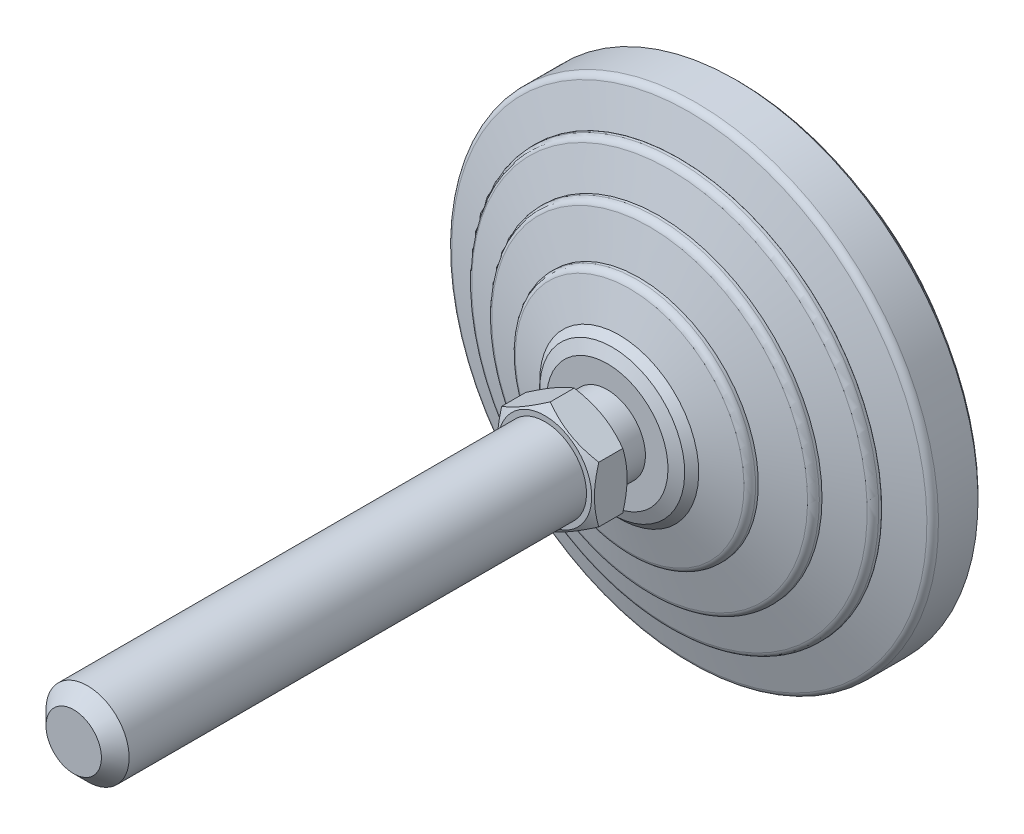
ISO-10303-21;
HEADER;
FILE_DESCRIPTION(('STEP AP214'),'2;1');
FILE_NAME('part.step','',(''),(''),'','','');
FILE_SCHEMA(('AUTOMOTIVE_DESIGN { 1 0 10303 214 1 1 1 1 }'));
ENDSEC;
DATA;
#1=APPLICATION_CONTEXT('core data for automotive mechanical design processes');
#2=APPLICATION_PROTOCOL_DEFINITION('international standard','automotive_design',2000,#1);
#3=PRODUCT_CONTEXT('',#1,'mechanical');
#4=PRODUCT('Part','Part','',(#3));
#5=PRODUCT_RELATED_PRODUCT_CATEGORY('part','',(#4));
#6=PRODUCT_DEFINITION_FORMATION('','',#4);
#7=PRODUCT_DEFINITION_CONTEXT('part definition',#1,'design');
#8=PRODUCT_DEFINITION('design','',#6,#7);
#9=PRODUCT_DEFINITION_SHAPE('','',#8);
#10=(LENGTH_UNIT() NAMED_UNIT(*) SI_UNIT(.MILLI.,.METRE.));
#11=(NAMED_UNIT(*) PLANE_ANGLE_UNIT() SI_UNIT($,.RADIAN.));
#12=(NAMED_UNIT(*) SI_UNIT($,.STERADIAN.) SOLID_ANGLE_UNIT());
#13=UNCERTAINTY_MEASURE_WITH_UNIT(LENGTH_MEASURE(1.E-05),#10,'distance_accuracy_value','');
#14=(GEOMETRIC_REPRESENTATION_CONTEXT(3) GLOBAL_UNCERTAINTY_ASSIGNED_CONTEXT((#13)) GLOBAL_UNIT_ASSIGNED_CONTEXT((#10,
#11,#12)) REPRESENTATION_CONTEXT('',''));
#15=CARTESIAN_POINT('',(0.,0.,0.));
#16=DIRECTION('',(0.,0.,1.));
#17=DIRECTION('',(1.,0.,0.));
#18=AXIS2_PLACEMENT_3D('',#15,#16,#17);
#19=CARTESIAN_POINT('',(-5.5,0.,26.));
#20=DIRECTION('',(0.,0.,1.));
#21=DIRECTION('',(0.,-1.,0.));
#22=AXIS2_PLACEMENT_3D('',#19,#20,#21);
#23=PLANE('',#22);
#24=CARTESIAN_POINT('',(0.,0.,25.9999999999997));
#25=DIRECTION('',(0.,0.,-1.));
#26=DIRECTION('',(-1.,0.,0.));
#27=AXIS2_PLACEMENT_3D('',#24,#25,#26);
#28=CIRCLE('',#27,6.75);
#29=CARTESIAN_POINT('',(-6.75,0.,25.9999999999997));
#30=VERTEX_POINT('',#29);
#31=EDGE_CURVE('E596',#30,#30,#28,.T.);
#32=ORIENTED_EDGE('',*,*,#31,.T.);
#33=EDGE_LOOP('',(#32));
#34=FACE_BOUND('',#33,.T.);
#35=CARTESIAN_POINT('',(0.,0.,26.));
#36=DIRECTION('',(0.,0.,-1.));
#37=DIRECTION('',(0.,1.,0.));
#38=AXIS2_PLACEMENT_3D('',#35,#36,#37);
#39=CIRCLE('',#38,5.5);
#40=CARTESIAN_POINT('',(0.,5.5,26.));
#41=VERTEX_POINT('',#40);
#42=EDGE_CURVE('E156',#41,#41,#39,.T.);
#43=ORIENTED_EDGE('',*,*,#42,.F.);
#44=EDGE_LOOP('',(#43));
#45=FACE_BOUND('',#44,.T.);
#46=ADVANCED_FACE('F14',(#34,#45),#23,.F.);
#47=CARTESIAN_POINT('',(0.,0.,0.));
#48=DIRECTION('',(0.,0.,-1.));
#49=DIRECTION('',(0.,1.,0.));
#50=AXIS2_PLACEMENT_3D('',#47,#48,#49);
#51=CYLINDRICAL_SURFACE('',#50,5.5);
#52=CARTESIAN_POINT('',(0.,0.,22.));
#53=DIRECTION('',(0.,0.,-1.));
#54=DIRECTION('',(0.,1.,0.));
#55=AXIS2_PLACEMENT_3D('',#52,#53,#54);
#56=CIRCLE('',#55,5.5);
#57=CARTESIAN_POINT('',(0.,5.5,22.));
#58=VERTEX_POINT('',#57);
#59=EDGE_CURVE('E153',#58,#58,#56,.T.);
#60=ORIENTED_EDGE('',*,*,#59,.F.);
#61=EDGE_LOOP('',(#60));
#62=FACE_BOUND('',#61,.T.);
#63=ORIENTED_EDGE('',*,*,#42,.T.);
#64=EDGE_LOOP('',(#63));
#65=FACE_BOUND('',#64,.T.);
#66=ADVANCED_FACE('F180',(#62,#65),#51,.T.);
#67=CARTESIAN_POINT('',(-8.75409836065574,0.,22.));
#68=DIRECTION('',(0.,0.,-1.));
#69=DIRECTION('',(0.,1.,0.));
#70=AXIS2_PLACEMENT_3D('',#67,#68,#69);
#71=PLANE('',#70);
#72=CARTESIAN_POINT('',(0.,0.,22.));
#73=DIRECTION('',(0.,0.,-1.));
#74=DIRECTION('',(0.,1.,0.));
#75=AXIS2_PLACEMENT_3D('',#72,#73,#74);
#76=CIRCLE('',#75,8.75409836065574);
#77=CARTESIAN_POINT('',(0.,8.75409836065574,22.));
#78=VERTEX_POINT('',#77);
#79=EDGE_CURVE('E150',#78,#78,#76,.T.);
#80=ORIENTED_EDGE('',*,*,#79,.F.);
#81=EDGE_LOOP('',(#80));
#82=FACE_BOUND('',#81,.T.);
#83=ORIENTED_EDGE('',*,*,#59,.T.);
#84=EDGE_LOOP('',(#83));
#85=FACE_BOUND('',#84,.T.);
#86=ADVANCED_FACE('F187',(#82,#85),#71,.F.);
#87=CARTESIAN_POINT('',(0.,0.,22.));
#88=DIRECTION('',(0.,0.,-1.));
#89=DIRECTION('',(0.,1.,0.));
#90=AXIS2_PLACEMENT_3D('',#87,#88,#89);
#91=CONICAL_SURFACE('',#90,8.75409836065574,1.17809724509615);
#92=CARTESIAN_POINT('',(0.,0.,21.2928932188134));
#93=DIRECTION('',(0.,0.,-1.));
#94=DIRECTION('',(0.,1.,0.));
#95=AXIS2_PLACEMENT_3D('',#92,#93,#94);
#96=CIRCLE('',#95,10.4612051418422);
#97=CARTESIAN_POINT('',(0.,10.4612051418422,21.2928932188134));
#98=VERTEX_POINT('',#97);
#99=EDGE_CURVE('E147',#98,#98,#96,.T.);
#100=ORIENTED_EDGE('',*,*,#99,.F.);
#101=EDGE_LOOP('',(#100));
#102=FACE_BOUND('',#101,.T.);
#103=ORIENTED_EDGE('',*,*,#79,.T.);
#104=EDGE_LOOP('',(#103));
#105=FACE_BOUND('',#104,.T.);
#106=ADVANCED_FACE('F459',(#102,#105),#91,.T.);
#107=CARTESIAN_POINT('',(0.,0.,21.2928932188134));
#108=DIRECTION('',(0.,0.,-1.));
#109=DIRECTION('',(0.,1.,0.));
#110=AXIS2_PLACEMENT_3D('',#107,#108,#109);
#111=CONICAL_SURFACE('',#110,10.4612051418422,0.785398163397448);
#112=CARTESIAN_POINT('',(0.,0.,20.2786885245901));
#113=DIRECTION('',(0.,0.,-1.));
#114=DIRECTION('',(0.,1.,0.));
#115=AXIS2_PLACEMENT_3D('',#112,#113,#114);
#116=CIRCLE('',#115,11.4754098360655);
#117=CARTESIAN_POINT('',(0.,11.4754098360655,20.2786885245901));
#118=VERTEX_POINT('',#117);
#119=EDGE_CURVE('E144',#118,#118,#116,.T.);
#120=ORIENTED_EDGE('',*,*,#119,.F.);
#121=EDGE_LOOP('',(#120));
#122=FACE_BOUND('',#121,.T.);
#123=ORIENTED_EDGE('',*,*,#99,.T.);
#124=EDGE_LOOP('',(#123));
#125=FACE_BOUND('',#124,.T.);
#126=ADVANCED_FACE('F449',(#122,#125),#111,.T.);
#127=CARTESIAN_POINT('',(0.,0.,20.2786885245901));
#128=DIRECTION('',(0.,0.,-1.));
#129=DIRECTION('',(0.,1.,0.));
#130=AXIS2_PLACEMENT_3D('',#127,#128,#129);
#131=CONICAL_SURFACE('',#130,11.4754098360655,1.27933953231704);
#132=CARTESIAN_POINT('',(0.,0.,18.7711726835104));
#133=DIRECTION('',(0.,0.,-1.));
#134=DIRECTION('',(0.,1.,0.));
#135=AXIS2_PLACEMENT_3D('',#132,#133,#134);
#136=CIRCLE('',#135,16.5004626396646);
#137=CARTESIAN_POINT('',(0.,16.5004626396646,18.7711726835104));
#138=VERTEX_POINT('',#137);
#139=EDGE_CURVE('E141',#138,#138,#136,.T.);
#140=ORIENTED_EDGE('',*,*,#139,.F.);
#141=EDGE_LOOP('',(#140));
#142=FACE_BOUND('',#141,.T.);
#143=ORIENTED_EDGE('',*,*,#119,.T.);
#144=EDGE_LOOP('',(#143));
#145=FACE_BOUND('',#144,.T.);
#146=ADVANCED_FACE('F439',(#142,#145),#131,.T.);
#147=CARTESIAN_POINT('',(0.,0.,17.8133463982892));
#148=DIRECTION('',(0.,0.,-1.));
#149=DIRECTION('',(0.,1.,0.));
#150=AXIS2_PLACEMENT_3D('',#147,#148,#149);
#151=TOROIDAL_SURFACE('',#150,16.2131147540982,1.);
#152=CARTESIAN_POINT('',(0.,0.,17.8133463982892));
#153=DIRECTION('',(0.,0.,-1.));
#154=DIRECTION('',(0.,1.,0.));
#155=AXIS2_PLACEMENT_3D('',#152,#153,#154);
#156=CIRCLE('',#155,17.2131147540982);
#157=CARTESIAN_POINT('',(0.,17.2131147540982,17.8133463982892));
#158=VERTEX_POINT('',#157);
#159=EDGE_CURVE('E138',#158,#158,#156,.T.);
#160=ORIENTED_EDGE('',*,*,#159,.F.);
#161=EDGE_LOOP('',(#160));
#162=FACE_BOUND('',#161,.T.);
#163=ORIENTED_EDGE('',*,*,#139,.T.);
#164=EDGE_LOOP('',(#163));
#165=FACE_BOUND('',#164,.T.);
#166=ADVANCED_FACE('F429',(#162,#165),#151,.T.);
#167=CARTESIAN_POINT('',(0.,0.,0.));
#168=DIRECTION('',(0.,0.,-1.));
#169=DIRECTION('',(0.,1.,0.));
#170=AXIS2_PLACEMENT_3D('',#167,#168,#169);
#171=CYLINDRICAL_SURFACE('',#170,17.2131147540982);
#172=CARTESIAN_POINT('',(0.,0.,17.4098360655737));
#173=DIRECTION('',(0.,0.,-1.));
#174=DIRECTION('',(0.,1.,0.));
#175=AXIS2_PLACEMENT_3D('',#172,#173,#174);
#176=CIRCLE('',#175,17.2131147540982);
#177=CARTESIAN_POINT('',(0.,17.2131147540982,17.4098360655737));
#178=VERTEX_POINT('',#177);
#179=EDGE_CURVE('E135',#178,#178,#176,.T.);
#180=ORIENTED_EDGE('',*,*,#179,.F.);
#181=EDGE_LOOP('',(#180));
#182=FACE_BOUND('',#181,.T.);
#183=ORIENTED_EDGE('',*,*,#159,.T.);
#184=EDGE_LOOP('',(#183));
#185=FACE_BOUND('',#184,.T.);
#186=ADVANCED_FACE('F419',(#182,#185),#171,.T.);
#187=CARTESIAN_POINT('',(0.,0.,17.4098360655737));
#188=DIRECTION('',(0.,0.,-1.));
#189=DIRECTION('',(0.,1.,0.));
#190=AXIS2_PLACEMENT_3D('',#187,#188,#189);
#191=CONICAL_SURFACE('',#190,17.2131147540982,1.30454427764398);
#192=CARTESIAN_POINT('',(0.,0.,15.8894925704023));
#193=DIRECTION('',(0.,0.,-1.));
#194=DIRECTION('',(0.,1.,0.));
#195=AXIS2_PLACEMENT_3D('',#192,#193,#194);
#196=CIRCLE('',#195,22.7877075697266);
#197=CARTESIAN_POINT('',(0.,22.7877075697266,15.8894925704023));
#198=VERTEX_POINT('',#197);
#199=EDGE_CURVE('E132',#198,#198,#196,.T.);
#200=ORIENTED_EDGE('',*,*,#199,.F.);
#201=EDGE_LOOP('',(#200));
#202=FACE_BOUND('',#201,.T.);
#203=ORIENTED_EDGE('',*,*,#179,.T.);
#204=EDGE_LOOP('',(#203));
#205=FACE_BOUND('',#204,.T.);
#206=ADVANCED_FACE('F409',(#202,#205),#191,.T.);
#207=CARTESIAN_POINT('',(0.,0.,14.9247287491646));
#208=DIRECTION('',(0.,0.,-1.));
#209=DIRECTION('',(0.,1.,0.));
#210=AXIS2_PLACEMENT_3D('',#207,#208,#209);
#211=TOROIDAL_SURFACE('',#210,22.5245901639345,1.);
#212=CARTESIAN_POINT('',(0.,0.,14.9247287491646));
#213=DIRECTION('',(0.,0.,-1.));
#214=DIRECTION('',(0.,1.,0.));
#215=AXIS2_PLACEMENT_3D('',#212,#213,#214);
#216=CIRCLE('',#215,23.5245901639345);
#217=CARTESIAN_POINT('',(0.,23.5245901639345,14.9247287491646));
#218=VERTEX_POINT('',#217);
#219=EDGE_CURVE('E129',#218,#218,#216,.T.);
#220=ORIENTED_EDGE('',*,*,#219,.F.);
#221=EDGE_LOOP('',(#220));
#222=FACE_BOUND('',#221,.T.);
#223=ORIENTED_EDGE('',*,*,#199,.T.);
#224=EDGE_LOOP('',(#223));
#225=FACE_BOUND('',#224,.T.);
#226=ADVANCED_FACE('F399',(#222,#225),#211,.T.);
#227=CARTESIAN_POINT('',(0.,0.,0.));
#228=DIRECTION('',(0.,0.,-1.));
#229=DIRECTION('',(0.,1.,0.));
#230=AXIS2_PLACEMENT_3D('',#227,#228,#229);
#231=CYLINDRICAL_SURFACE('',#230,23.5245901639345);
#232=CARTESIAN_POINT('',(0.,0.,14.5409836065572));
#233=DIRECTION('',(0.,0.,-1.));
#234=DIRECTION('',(0.,1.,0.));
#235=AXIS2_PLACEMENT_3D('',#232,#233,#234);
#236=CIRCLE('',#235,23.5245901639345);
#237=CARTESIAN_POINT('',(0.,23.5245901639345,14.5409836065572));
#238=VERTEX_POINT('',#237);
#239=EDGE_CURVE('E126',#238,#238,#236,.T.);
#240=ORIENTED_EDGE('',*,*,#239,.F.);
#241=EDGE_LOOP('',(#240));
#242=FACE_BOUND('',#241,.T.);
#243=ORIENTED_EDGE('',*,*,#219,.T.);
#244=EDGE_LOOP('',(#243));
#245=FACE_BOUND('',#244,.T.);
#246=ADVANCED_FACE('F389',(#242,#245),#231,.T.);
#247=CARTESIAN_POINT('',(0.,0.,14.5409836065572));
#248=DIRECTION('',(0.,0.,-1.));
#249=DIRECTION('',(0.,1.,0.));
#250=AXIS2_PLACEMENT_3D('',#247,#248,#249);
#251=CONICAL_SURFACE('',#250,23.5245901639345,1.2787125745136);
#252=CARTESIAN_POINT('',(0.,0.,13.0337743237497));
#253=DIRECTION('',(0.,0.,-1.));
#254=DIRECTION('',(0.,1.,0.));
#255=AXIS2_PLACEMENT_3D('',#252,#253,#254);
#256=CIRCLE('',#255,28.5372004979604);
#257=CARTESIAN_POINT('',(0.,28.5372004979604,13.0337743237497));
#258=VERTEX_POINT('',#257);
#259=EDGE_CURVE('E123',#258,#258,#256,.T.);
#260=ORIENTED_EDGE('',*,*,#259,.F.);
#261=EDGE_LOOP('',(#260));
#262=FACE_BOUND('',#261,.T.);
#263=ORIENTED_EDGE('',*,*,#239,.T.);
#264=EDGE_LOOP('',(#263));
#265=FACE_BOUND('',#264,.T.);
#266=ADVANCED_FACE('F379',(#262,#265),#251,.T.);
#267=CARTESIAN_POINT('',(0.,0.,12.0761283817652));
#268=DIRECTION('',(0.,0.,-1.));
#269=DIRECTION('',(0.,1.,0.));
#270=AXIS2_PLACEMENT_3D('',#267,#268,#269);
#271=TOROIDAL_SURFACE('',#270,28.2492521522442,1.);
#272=CARTESIAN_POINT('',(0.,0.,12.0761283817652));
#273=DIRECTION('',(0.,0.,-1.));
#274=DIRECTION('',(0.,1.,0.));
#275=AXIS2_PLACEMENT_3D('',#272,#273,#274);
#276=CIRCLE('',#275,29.2492521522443);
#277=CARTESIAN_POINT('',(0.,29.2492521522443,12.0761283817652));
#278=VERTEX_POINT('',#277);
#279=EDGE_CURVE('E120',#278,#278,#276,.T.);
#280=ORIENTED_EDGE('',*,*,#279,.F.);
#281=EDGE_LOOP('',(#280));
#282=FACE_BOUND('',#281,.T.);
#283=ORIENTED_EDGE('',*,*,#259,.T.);
#284=EDGE_LOOP('',(#283));
#285=FACE_BOUND('',#284,.T.);
#286=ADVANCED_FACE('F369',(#282,#285),#271,.T.);
#287=CARTESIAN_POINT('',(0.,0.,0.));
#288=DIRECTION('',(0.,0.,-1.));
#289=DIRECTION('',(0.,1.,0.));
#290=AXIS2_PLACEMENT_3D('',#287,#288,#289);
#291=CYLINDRICAL_SURFACE('',#290,29.2492521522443);
#292=CARTESIAN_POINT('',(0.,0.,11.672131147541));
#293=DIRECTION('',(0.,0.,-1.));
#294=DIRECTION('',(0.,1.,0.));
#295=AXIS2_PLACEMENT_3D('',#292,#293,#294);
#296=CIRCLE('',#295,29.2492521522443);
#297=CARTESIAN_POINT('',(0.,29.2492521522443,11.672131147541));
#298=VERTEX_POINT('',#297);
#299=EDGE_CURVE('E117',#298,#298,#296,.T.);
#300=ORIENTED_EDGE('',*,*,#299,.F.);
#301=EDGE_LOOP('',(#300));
#302=FACE_BOUND('',#301,.T.);
#303=ORIENTED_EDGE('',*,*,#279,.T.);
#304=EDGE_LOOP('',(#303));
#305=FACE_BOUND('',#304,.T.);
#306=ADVANCED_FACE('F359',(#302,#305),#291,.T.);
#307=CARTESIAN_POINT('',(-29.2622950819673,0.,11.672131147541));
#308=DIRECTION('',(0.,0.,-1.));
#309=DIRECTION('',(0.,1.,0.));
#310=AXIS2_PLACEMENT_3D('',#307,#308,#309);
#311=PLANE('',#310);
#312=CARTESIAN_POINT('',(0.,0.,11.672131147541));
#313=DIRECTION('',(0.,0.,-1.));
#314=DIRECTION('',(0.,1.,0.));
#315=AXIS2_PLACEMENT_3D('',#312,#313,#314);
#316=CIRCLE('',#315,29.2622950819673);
#317=CARTESIAN_POINT('',(0.,29.2622950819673,11.672131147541));
#318=VERTEX_POINT('',#317);
#319=EDGE_CURVE('E114',#318,#318,#316,.T.);
#320=ORIENTED_EDGE('',*,*,#319,.F.);
#321=EDGE_LOOP('',(#320));
#322=FACE_BOUND('',#321,.T.);
#323=ORIENTED_EDGE('',*,*,#299,.T.);
#324=EDGE_LOOP('',(#323));
#325=FACE_BOUND('',#324,.T.);
#326=ADVANCED_FACE('F349',(#322,#325),#311,.F.);
#327=CARTESIAN_POINT('',(0.,0.,11.672131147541));
#328=DIRECTION('',(0.,0.,-1.));
#329=DIRECTION('',(0.,1.,0.));
#330=AXIS2_PLACEMENT_3D('',#327,#328,#329);
#331=CONICAL_SURFACE('',#330,29.2622950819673,1.27933953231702);
#332=CARTESIAN_POINT('',(0.,0.,10.1646153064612));
#333=DIRECTION('',(0.,0.,-1.));
#334=DIRECTION('',(0.,1.,0.));
#335=AXIS2_PLACEMENT_3D('',#332,#333,#334);
#336=CIRCLE('',#335,34.2873478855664);
#337=CARTESIAN_POINT('',(0.,34.2873478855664,10.1646153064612));
#338=VERTEX_POINT('',#337);
#339=EDGE_CURVE('E111',#338,#338,#336,.T.);
#340=ORIENTED_EDGE('',*,*,#339,.F.);
#341=EDGE_LOOP('',(#340));
#342=FACE_BOUND('',#341,.T.);
#343=ORIENTED_EDGE('',*,*,#319,.T.);
#344=EDGE_LOOP('',(#343));
#345=FACE_BOUND('',#344,.T.);
#346=ADVANCED_FACE('F339',(#342,#345),#331,.T.);
#347=CARTESIAN_POINT('',(0.,0.,9.20678902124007));
#348=DIRECTION('',(0.,0.,-1.));
#349=DIRECTION('',(0.,1.,0.));
#350=AXIS2_PLACEMENT_3D('',#347,#348,#349);
#351=TOROIDAL_SURFACE('',#350,34.,1.);
#352=CARTESIAN_POINT('',(0.,0.,9.20678902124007));
#353=DIRECTION('',(0.,0.,-1.));
#354=DIRECTION('',(0.,1.,0.));
#355=AXIS2_PLACEMENT_3D('',#352,#353,#354);
#356=CIRCLE('',#355,35.);
#357=CARTESIAN_POINT('',(0.,35.,9.20678902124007));
#358=VERTEX_POINT('',#357);
#359=EDGE_CURVE('E108',#358,#358,#356,.T.);
#360=ORIENTED_EDGE('',*,*,#359,.F.);
#361=EDGE_LOOP('',(#360));
#362=FACE_BOUND('',#361,.T.);
#363=ORIENTED_EDGE('',*,*,#339,.T.);
#364=EDGE_LOOP('',(#363));
#365=FACE_BOUND('',#364,.T.);
#366=ADVANCED_FACE('F329',(#362,#365),#351,.T.);
#367=CARTESIAN_POINT('',(0.,0.,0.));
#368=DIRECTION('',(0.,0.,-1.));
#369=DIRECTION('',(0.,1.,0.));
#370=AXIS2_PLACEMENT_3D('',#367,#368,#369);
#371=CYLINDRICAL_SURFACE('',#370,35.);
#372=CARTESIAN_POINT('',(0.,0.,3.5));
#373=DIRECTION('',(0.,0.,-1.));
#374=DIRECTION('',(0.,1.,0.));
#375=AXIS2_PLACEMENT_3D('',#372,#373,#374);
#376=CIRCLE('',#375,35.);
#377=CARTESIAN_POINT('',(0.,35.,3.5));
#378=VERTEX_POINT('',#377);
#379=EDGE_CURVE('E105',#378,#378,#376,.T.);
#380=ORIENTED_EDGE('',*,*,#379,.F.);
#381=EDGE_LOOP('',(#380));
#382=FACE_BOUND('',#381,.T.);
#383=ORIENTED_EDGE('',*,*,#359,.T.);
#384=EDGE_LOOP('',(#383));
#385=FACE_BOUND('',#384,.T.);
#386=ADVANCED_FACE('F319',(#382,#385),#371,.T.);
#387=CARTESIAN_POINT('',(0.,0.,3.5));
#388=DIRECTION('',(0.,0.,1.));
#389=DIRECTION('',(0.,-1.,0.));
#390=AXIS2_PLACEMENT_3D('',#387,#388,#389);
#391=CONICAL_SURFACE('',#390,35.,0.785398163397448);
#392=CARTESIAN_POINT('',(0.,0.,3.));
#393=DIRECTION('',(0.,0.,-1.));
#394=DIRECTION('',(0.,1.,0.));
#395=AXIS2_PLACEMENT_3D('',#392,#393,#394);
#396=CIRCLE('',#395,34.5);
#397=CARTESIAN_POINT('',(0.,34.5,3.));
#398=VERTEX_POINT('',#397);
#399=EDGE_CURVE('E102',#398,#398,#396,.T.);
#400=ORIENTED_EDGE('',*,*,#399,.F.);
#401=EDGE_LOOP('',(#400));
#402=FACE_BOUND('',#401,.T.);
#403=ORIENTED_EDGE('',*,*,#379,.T.);
#404=EDGE_LOOP('',(#403));
#405=FACE_BOUND('',#404,.T.);
#406=ADVANCED_FACE('F309',(#402,#405),#391,.T.);
#407=CARTESIAN_POINT('',(-34.5,0.,3.));
#408=DIRECTION('',(0.,0.,1.));
#409=DIRECTION('',(0.,-1.,0.));
#410=AXIS2_PLACEMENT_3D('',#407,#408,#409);
#411=PLANE('',#410);
#412=CARTESIAN_POINT('',(0.,0.,3.));
#413=DIRECTION('',(0.,0.,-1.));
#414=DIRECTION('',(0.,1.,0.));
#415=AXIS2_PLACEMENT_3D('',#412,#413,#414);
#416=CIRCLE('',#415,30.4098360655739);
#417=CARTESIAN_POINT('',(0.,30.4098360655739,3.));
#418=VERTEX_POINT('',#417);
#419=EDGE_CURVE('E99',#418,#418,#416,.T.);
#420=ORIENTED_EDGE('',*,*,#419,.F.);
#421=EDGE_LOOP('',(#420));
#422=FACE_BOUND('',#421,.T.);
#423=ORIENTED_EDGE('',*,*,#399,.T.);
#424=EDGE_LOOP('',(#423));
#425=FACE_BOUND('',#424,.T.);
#426=ADVANCED_FACE('F299',(#422,#425),#411,.F.);
#427=CARTESIAN_POINT('',(0.,0.,0.));
#428=DIRECTION('',(0.,0.,-1.));
#429=DIRECTION('',(0.,1.,0.));
#430=AXIS2_PLACEMENT_3D('',#427,#428,#429);
#431=CYLINDRICAL_SURFACE('',#430,30.4098360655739);
#432=CARTESIAN_POINT('',(0.,0.,0.));
#433=DIRECTION('',(0.,0.,-1.));
#434=DIRECTION('',(0.,1.,0.));
#435=AXIS2_PLACEMENT_3D('',#432,#433,#434);
#436=CIRCLE('',#435,30.4098360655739);
#437=CARTESIAN_POINT('',(0.,30.4098360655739,0.));
#438=VERTEX_POINT('',#437);
#439=EDGE_CURVE('E96',#438,#438,#436,.T.);
#440=ORIENTED_EDGE('',*,*,#439,.F.);
#441=EDGE_LOOP('',(#440));
#442=FACE_BOUND('',#441,.T.);
#443=ORIENTED_EDGE('',*,*,#419,.T.);
#444=EDGE_LOOP('',(#443));
#445=FACE_BOUND('',#444,.T.);
#446=ADVANCED_FACE('F288',(#442,#445),#431,.T.);
#447=CARTESIAN_POINT('',(-30.4098360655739,0.,0.));
#448=DIRECTION('',(0.,0.,1.));
#449=DIRECTION('',(0.,-1.,0.));
#450=AXIS2_PLACEMENT_3D('',#447,#448,#449);
#451=PLANE('',#450);
#452=ORIENTED_EDGE('',*,*,#439,.T.);
#453=EDGE_LOOP('',(#452));
#454=FACE_BOUND('',#453,.T.);
#455=ADVANCED_FACE('F178',(#454),#451,.F.);
#456=CARTESIAN_POINT('',(0.,0.,27.3430145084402));
#457=DIRECTION('',(0.,0.,1.));
#458=DIRECTION('',(1.,0.,0.));
#459=AXIS2_PLACEMENT_3D('',#456,#457,#458);
#460=CONICAL_SURFACE('',#459,9.07616936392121,1.0471975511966);
#461=CARTESIAN_POINT('',(0.258297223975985,-8.23203174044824,26.8579904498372));
#462=CARTESIAN_POINT('',(-0.0683716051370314,-8.04342940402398,26.7432267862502));
#463=CARTESIAN_POINT('',(-0.398095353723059,-7.85306330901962,26.6381850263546));
#464=CARTESIAN_POINT('',(-1.06392424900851,-7.46864681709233,26.4537610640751));
#465=CARTESIAN_POINT('',(-1.40004627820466,-7.27458667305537,26.3744610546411));
#466=CARTESIAN_POINT('',(-1.90281138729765,-6.98431510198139,26.2809264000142));
#467=CARTESIAN_POINT('',(-2.06770572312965,-6.88911331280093,26.2542044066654));
#468=CARTESIAN_POINT('',(-2.39835821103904,-6.69821100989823,26.2091111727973));
#469=CARTESIAN_POINT('',(-2.56411637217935,-6.6025104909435,26.1907400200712));
#470=CARTESIAN_POINT('',(-2.89592662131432,-6.41093975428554,26.1628727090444));
#471=CARTESIAN_POINT('',(-3.0619778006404,-6.31507006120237,26.1533622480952));
#472=CARTESIAN_POINT('',(-3.39428499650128,-6.12321241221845,26.1434370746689));
#473=CARTESIAN_POINT('',(-3.56054101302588,-6.02722445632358,26.1430223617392));
#474=CARTESIAN_POINT('',(-3.90322039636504,-5.82937842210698,26.1515607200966));
#475=CARTESIAN_POINT('',(-4.07963294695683,-5.72752658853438,26.161098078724));
#476=CARTESIAN_POINT('',(-4.43183985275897,-5.52417983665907,26.1901437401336));
#477=CARTESIAN_POINT('',(-4.60763418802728,-5.4226849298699,26.2096523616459));
#478=CARTESIAN_POINT('',(-4.95857322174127,-5.22007018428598,26.2580913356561));
#479=CARTESIAN_POINT('',(-5.13371607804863,-5.11895140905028,26.2870393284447));
#480=CARTESIAN_POINT('',(-5.48277281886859,-4.91742340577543,26.3535538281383));
#481=CARTESIAN_POINT('',(-5.65668661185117,-4.81701423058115,26.3911209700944));
#482=CARTESIAN_POINT('',(-6.00865056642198,-4.61380774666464,26.4752981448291));
#483=CARTESIAN_POINT('',(-6.18665551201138,-4.51103654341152,26.5221585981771));
#484=CARTESIAN_POINT('',(-6.54113299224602,-4.30637887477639,26.6231022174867));
#485=CARTESIAN_POINT('',(-6.71760536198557,-4.20449250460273,26.6771861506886));
#486=CARTESIAN_POINT('',(-7.0682845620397,-4.00202777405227,26.791373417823));
#487=CARTESIAN_POINT('',(-7.24249774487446,-3.90144574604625,26.8514509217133));
#488=CARTESIAN_POINT('',(-7.58940588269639,-3.70115823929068,26.9769491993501));
#489=CARTESIAN_POINT('',(-7.76210138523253,-3.6014524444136,27.0423679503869));
#490=CARTESIAN_POINT('',(-7.93410750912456,-3.50214466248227,27.1100498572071));
#491=B_SPLINE_CURVE_WITH_KNOTS('',3,(#461,#462,#463,#464,#465,#466,#467,#468,#469,#470,#471,
#472,#473,#474,#475,#476,#477,#478,#479,#480,#481,#482,#483,#484,#485,#486,#487,#488,#489,#490),
.UNSPECIFIED.,.F.,.F.,(4,2,2,2,2,2,2,2,2,2,2,2,2,2,4),(0.,1.18357471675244,2.37089222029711,
2.94753203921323,3.52417792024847,4.0998913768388,4.6756048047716,5.28712801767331,
5.89867077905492,6.51136300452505,7.12410038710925,7.75640078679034,8.38876839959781,
9.01851969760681,9.6480336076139),.UNSPECIFIED.);
#492=CARTESIAN_POINT('',(0.,-8.08290376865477,26.7695523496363));
#493=VERTEX_POINT('',#492);
#494=CARTESIAN_POINT('',(-7.,-4.04145188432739,26.7695523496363));
#495=VERTEX_POINT('',#494);
#496=EDGE_CURVE('E73',#493,#495,#491,.T.);
#497=ORIENTED_EDGE('',*,*,#496,.T.);
#498=CARTESIAN_POINT('',(-7.,-10.7781609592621,29.5228756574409));
#499=CARTESIAN_POINT('',(-7.,-10.4730654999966,29.3751910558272));
#500=CARTESIAN_POINT('',(-7.,-10.1672612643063,29.2289451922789));
#501=CARTESIAN_POINT('',(-7.,-9.5538579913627,28.9401417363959));
#502=CARTESIAN_POINT('',(-7.,-9.24625867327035,28.7975847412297));
#503=CARTESIAN_POINT('',(-7.,-8.62726554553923,28.5162359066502));
#504=CARTESIAN_POINT('',(-7.,-8.31586014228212,28.3774694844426));
#505=CARTESIAN_POINT('',(-7.,-7.69054518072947,28.1057203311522));
#506=CARTESIAN_POINT('',(-7.,-7.37663574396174,27.9727373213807));
#507=CARTESIAN_POINT('',(-7.,-6.73598975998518,27.7100567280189));
#508=CARTESIAN_POINT('',(-7.,-6.40915798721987,27.580590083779));
#509=CARTESIAN_POINT('',(-7.,-5.75164295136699,27.3316447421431));
#510=CARTESIAN_POINT('',(-7.,-5.42095925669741,27.2121671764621));
#511=CARTESIAN_POINT('',(-7.,-4.75585475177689,26.986393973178));
#512=CARTESIAN_POINT('',(-7.,-4.42144333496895,26.8800709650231));
#513=CARTESIAN_POINT('',(-7.,-3.74783685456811,26.6840681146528));
#514=CARTESIAN_POINT('',(-7.,-3.4086433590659,26.5943829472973));
#515=CARTESIAN_POINT('',(-7.,-2.72708824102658,26.4364889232));
#516=CARTESIAN_POINT('',(-7.,-2.38475361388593,26.368166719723));
#517=CARTESIAN_POINT('',(-7.,-1.8681974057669,26.2847025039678));
#518=CARTESIAN_POINT('',(-7.,-1.69548967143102,26.2600497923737));
#519=CARTESIAN_POINT('',(-7.,-1.34924244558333,26.2175692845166));
#520=CARTESIAN_POINT('',(-7.,-1.17570303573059,26.1997408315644));
#521=CARTESIAN_POINT('',(-7.,-0.830257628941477,26.1714836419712));
#522=CARTESIAN_POINT('',(-7.,-0.65835917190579,26.1609630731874));
#523=CARTESIAN_POINT('',(-7.,-0.314271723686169,26.1471949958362));
#524=CARTESIAN_POINT('',(-7.,-0.142082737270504,26.1439473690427));
#525=CARTESIAN_POINT('',(-7.,0.202278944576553,26.1448024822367));
#526=CARTESIAN_POINT('',(-7.,0.374451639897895,26.1489052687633));
#527=CARTESIAN_POINT('',(-7.,0.718473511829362,26.1643623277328));
#528=CARTESIAN_POINT('',(-7.,0.890322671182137,26.1757169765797));
#529=CARTESIAN_POINT('',(-7.,1.30571265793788,26.2116903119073));
#530=CARTESIAN_POINT('',(-7.,1.54895033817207,26.2398819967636));
#531=CARTESIAN_POINT('',(-7.,2.0335574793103,26.3092372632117));
#532=CARTESIAN_POINT('',(-7.,2.27492667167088,26.3504026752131));
#533=CARTESIAN_POINT('',(-7.,2.99599093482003,26.491171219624));
#534=CARTESIAN_POINT('',(-7.,3.47236046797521,26.608019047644));
#535=CARTESIAN_POINT('',(-7.,4.18456053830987,26.8098484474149));
#536=CARTESIAN_POINT('',(-7.,4.42410489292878,26.8824719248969));
#537=CARTESIAN_POINT('',(-7.,4.90086572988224,27.0350633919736));
#538=CARTESIAN_POINT('',(-7.,5.13808219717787,27.115031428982));
#539=CARTESIAN_POINT('',(-7.,5.61026576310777,27.2810455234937));
#540=CARTESIAN_POINT('',(-7.,5.8452336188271,27.3670894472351));
#541=CARTESIAN_POINT('',(-7.,6.31323600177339,27.5442627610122));
#542=CARTESIAN_POINT('',(-7.,6.5462705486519,27.635392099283));
#543=CARTESIAN_POINT('',(-7.,7.08359825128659,27.851197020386));
#544=CARTESIAN_POINT('',(-7.,7.3872707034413,27.9774149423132));
#545=CARTESIAN_POINT('',(-7.,7.99214076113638,28.2356638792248));
#546=CARTESIAN_POINT('',(-7.,8.2933382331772,28.3676952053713));
#547=CARTESIAN_POINT('',(-7.,8.89369751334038,28.6364380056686));
#548=CARTESIAN_POINT('',(-7.,9.19285894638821,28.7731503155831));
#549=CARTESIAN_POINT('',(-7.,9.78943219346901,29.0503469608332));
#550=CARTESIAN_POINT('',(-7.,10.086843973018,29.1908313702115));
#551=CARTESIAN_POINT('',(-7.,10.6804814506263,29.4750207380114));
#552=CARTESIAN_POINT('',(-7.,10.9767056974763,29.6187287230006));
#553=CARTESIAN_POINT('',(-7.,11.5679029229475,29.9086981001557));
#554=CARTESIAN_POINT('',(-7.,11.8628758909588,30.0549595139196));
#555=CARTESIAN_POINT('',(-7.,12.7461384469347,30.49687770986));
#556=CARTESIAN_POINT('',(-7.,13.3328427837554,30.7957027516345));
#557=CARTESIAN_POINT('',(-7.,14.4561889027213,31.3751252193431));
#558=CARTESIAN_POINT('',(-7.,14.9930698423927,31.6552609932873));
#559=CARTESIAN_POINT('',(-7.,16.0648279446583,32.2193776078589));
#560=CARTESIAN_POINT('',(-7.,16.5997050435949,32.5033585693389));
#561=CARTESIAN_POINT('',(-7.,17.6666533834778,33.0736030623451));
#562=CARTESIAN_POINT('',(-7.,18.198728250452,33.3598598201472));
#563=CARTESIAN_POINT('',(-7.,19.2615892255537,33.934692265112));
#564=CARTESIAN_POINT('',(-7.,19.7923753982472,34.22326783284));
#565=CARTESIAN_POINT('',(-7.,20.3226835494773,34.5127133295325));
#566=B_SPLINE_CURVE_WITH_KNOTS('',3,(#498,#499,#500,#501,#502,#503,#504,#505,#506,#507,#508,
#509,#510,#511,#512,#513,#514,#515,#516,#517,#518,#519,#520,#521,#522,#523,#524,#525,#526,#527,
#528,#529,#530,#531,#532,#533,#534,#535,#536,#537,#538,#539,#540,#541,#542,#543,#544,#545,#546,
#547,#548,#549,#550,#551,#552,#553,#554,#555,#556,#557,#558,#559,#560,#561,#562,#563,#564,#565),
.UNSPECIFIED.,.F.,.F.,(4,2,2,2,2,2,2,2,2,2,2,2,2,2,2,2,2,2,2,2,2,2,2,2,2,2,2,2,2,2,2,2,2,4),(0.,
1.01689323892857,2.03395007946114,3.05667619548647,4.07935297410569,5.13384739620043,
6.18846112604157,7.2408422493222,8.29288596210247,9.33924915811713,9.86251056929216,
10.3857216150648,10.902232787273,11.4187355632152,11.935241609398,12.4517744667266,
13.1859558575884,13.9202408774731,15.3896578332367,16.1405312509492,16.8914095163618,
17.6420253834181,18.3926336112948,19.3791289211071,20.3656770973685,21.3524023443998,
22.3391469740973,23.326860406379,24.3145821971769,26.2897889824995,28.1064876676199,
29.9232435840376,31.7358100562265,33.5482837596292),.UNSPECIFIED.);
#567=CARTESIAN_POINT('',(-7.,4.04145188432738,26.7695523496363));
#568=VERTEX_POINT('',#567);
#569=EDGE_CURVE('E81',#495,#568,#566,.T.);
#570=ORIENTED_EDGE('',*,*,#569,.T.);
#571=CARTESIAN_POINT('',(-12.64986971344,0.779498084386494,29.4201443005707));
#572=CARTESIAN_POINT('',(-12.3820376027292,0.934131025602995,29.2713412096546));
#573=CARTESIAN_POINT('',(-12.113550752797,1.08914198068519,29.1240792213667));
#574=CARTESIAN_POINT('',(-11.5749070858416,1.40012804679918,28.8335344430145));
#575=CARTESIAN_POINT('',(-11.304749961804,1.55610333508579,28.6902524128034));
#576=CARTESIAN_POINT('',(-10.760792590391,1.87015726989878,28.4077314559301));
#577=CARTESIAN_POINT('',(-10.4869801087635,2.02824297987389,28.2685238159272));
#578=CARTESIAN_POINT('',(-9.93701864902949,2.34576337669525,27.9964301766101));
#579=CARTESIAN_POINT('',(-9.66086980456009,2.50519798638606,27.8635438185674));
#580=CARTESIAN_POINT('',(-9.10332502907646,2.82709661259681,27.6046779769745));
#581=CARTESIAN_POINT('',(-8.82190432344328,2.98957493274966,27.4787692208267));
#582=CARTESIAN_POINT('',(-8.25563981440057,3.316507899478,27.2374603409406));
#583=CARTESIAN_POINT('',(-7.97079560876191,3.48096277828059,27.1220614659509));
#584=CARTESIAN_POINT('',(-7.39789519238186,3.81172698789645,26.9051147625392));
#585=CARTESIAN_POINT('',(-7.10984839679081,3.97803088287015,26.8035341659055));
#586=CARTESIAN_POINT('',(-6.52963557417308,4.31301691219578,26.6177494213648));
#587=CARTESIAN_POINT('',(-6.23747100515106,4.48169820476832,26.5335392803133));
#588=CARTESIAN_POINT('',(-5.6525554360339,4.81939936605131,26.3877952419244));
#589=CARTESIAN_POINT('',(-5.35985536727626,4.98838982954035,26.3259964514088));
#590=CARTESIAN_POINT('',(-4.9184216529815,5.24325170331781,26.2524003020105));
#591=CARTESIAN_POINT('',(-4.770860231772,5.32844632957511,26.23105037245));
#592=CARTESIAN_POINT('',(-4.47512356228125,5.49918997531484,26.1951411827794));
#593=CARTESIAN_POINT('',(-4.32694837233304,5.58473896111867,26.1805812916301));
#594=CARTESIAN_POINT('',(-4.03101211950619,5.75559783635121,26.1586342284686));
#595=CARTESIAN_POINT('',(-3.88325322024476,5.84090647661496,26.1512082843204));
#596=CARTESIAN_POINT('',(-3.58759658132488,6.01160391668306,26.1435597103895));
#597=CARTESIAN_POINT('',(-3.43969884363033,6.09699271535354,26.1433369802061));
#598=CARTESIAN_POINT('',(-3.14406385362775,6.26767765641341,26.1500999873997));
#599=CARTESIAN_POINT('',(-2.99632657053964,6.35297381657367,26.1570839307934));
#600=CARTESIAN_POINT('',(-2.70122581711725,6.52335031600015,26.1780954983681));
#601=CARTESIAN_POINT('',(-2.55386236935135,6.6084306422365,26.1921235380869));
#602=CARTESIAN_POINT('',(-2.1895532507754,6.81876460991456,26.2352300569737));
#603=CARTESIAN_POINT('',(-1.97295522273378,6.94381753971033,26.2682960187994));
#604=CARTESIAN_POINT('',(-1.541606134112,7.19285705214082,26.3477410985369));
#605=CARTESIAN_POINT('',(-1.32685538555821,7.31684345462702,26.3941224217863));
#606=CARTESIAN_POINT('',(-0.684923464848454,7.68746302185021,26.5508919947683));
#607=CARTESIAN_POINT('',(-0.260920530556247,7.93226123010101,26.6787919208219));
#608=CARTESIAN_POINT('',(0.372911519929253,8.29820433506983,26.8971326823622));
#609=CARTESIAN_POINT('',(0.586094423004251,8.4212855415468,26.9753121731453));
#610=CARTESIAN_POINT('',(1.01040228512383,8.66625979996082,27.1389237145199));
#611=CARTESIAN_POINT('',(1.22152706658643,8.78815274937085,27.2243563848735));
#612=CARTESIAN_POINT('',(1.64065895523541,9.0301386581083,27.4006858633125));
#613=CARTESIAN_POINT('',(1.84867702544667,9.15023794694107,27.4915482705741));
#614=CARTESIAN_POINT('',(2.26297890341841,9.38943524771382,27.678182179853));
#615=CARTESIAN_POINT('',(2.46926326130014,9.50853357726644,27.7739520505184));
#616=CARTESIAN_POINT('',(2.67482329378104,9.62721371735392,27.8717077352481));
#617=B_SPLINE_CURVE_WITH_KNOTS('',3,(#571,#572,#573,#574,#575,#576,#577,#578,#579,#580,#581,
#582,#583,#584,#585,#586,#587,#588,#589,#590,#591,#592,#593,#594,#595,#596,#597,#598,#599,#600,
#601,#602,#603,#604,#605,#606,#607,#608,#609,#610,#611,#612,#613,#614,#615,#616),.UNSPECIFIED.,
.F.,.F.,(4,2,2,2,2,2,2,2,2,2,2,2,2,2,2,2,2,2,2,2,2,2,4),(0.,1.02962187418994,2.05943899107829,
3.09576652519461,4.13203517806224,5.17738443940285,6.22285774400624,7.26580694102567,
8.30839569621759,9.33822558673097,9.85327614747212,10.3682788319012,10.8804664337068,
11.3926468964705,11.9046998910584,12.4167830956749,13.1731941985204,13.929730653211,
15.4457819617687,16.2205658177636,16.9954159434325,17.765791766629,18.5359131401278),.UNSPECIFIED.);
#618=CARTESIAN_POINT('',(0.,8.08290376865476,26.7695523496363));
#619=VERTEX_POINT('',#618);
#620=EDGE_CURVE('E551',#568,#619,#617,.T.);
#621=ORIENTED_EDGE('',*,*,#620,.T.);
#622=CARTESIAN_POINT('',(-0.939873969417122,8.62554025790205,27.1123203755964));
#623=CARTESIAN_POINT('',(-0.767785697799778,8.5261850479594,27.0445488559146));
#624=CARTESIAN_POINT('',(-0.595007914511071,8.42643174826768,26.9790390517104));
#625=CARTESIAN_POINT('',(-0.247934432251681,8.22604877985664,26.8533561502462));
#626=CARTESIAN_POINT('',(-0.073638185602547,8.12541879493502,26.7931850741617));
#627=CARTESIAN_POINT('',(0.277210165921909,7.92285640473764,26.6788077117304));
#628=CARTESIAN_POINT('',(0.453768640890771,7.82092032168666,26.6246272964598));
#629=CARTESIAN_POINT('',(0.80842032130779,7.61616207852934,26.5234896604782));
#630=CARTESIAN_POINT('',(0.986513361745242,7.51334001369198,26.4765316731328));
#631=CARTESIAN_POINT('',(1.33865063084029,7.31003346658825,26.3921636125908));
#632=CARTESIAN_POINT('',(1.51264953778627,7.20957515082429,26.3545029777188));
#633=CARTESIAN_POINT('',(1.86187962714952,7.0079470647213,26.2878037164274));
#634=CARTESIAN_POINT('',(2.03711071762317,6.90677734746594,26.258764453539));
#635=CARTESIAN_POINT('',(2.38822928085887,6.70405895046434,26.2101479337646));
#636=CARTESIAN_POINT('',(2.56411490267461,6.60251133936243,26.1905530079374));
#637=CARTESIAN_POINT('',(2.91650803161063,6.39905707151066,26.1613423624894));
#638=CARTESIAN_POINT('',(3.09301551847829,6.29715042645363,26.151726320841));
#639=CARTESIAN_POINT('',(3.43572037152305,6.09928968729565,26.1430493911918));
#640=CARTESIAN_POINT('',(3.60190656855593,6.00334204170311,26.143394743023));
#641=CARTESIAN_POINT('',(3.93407717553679,5.81156325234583,26.1531746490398));
#642=CARTESIAN_POINT('',(4.10006158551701,5.71573210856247,26.1626092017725));
#643=CARTESIAN_POINT('',(4.43174093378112,5.52423694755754,26.1903203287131));
#644=CARTESIAN_POINT('',(4.59743497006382,5.42857345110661,26.208611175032));
#645=CARTESIAN_POINT('',(4.92796219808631,5.23774346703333,26.2535417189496));
#646=CARTESIAN_POINT('',(5.09279539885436,5.1425769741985,26.2801813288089));
#647=CARTESIAN_POINT('',(5.59537059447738,4.85241504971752,26.3734628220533));
#648=CARTESIAN_POINT('',(5.93136806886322,4.65842681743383,26.4525915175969));
#649=CARTESIAN_POINT('',(6.596957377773,4.27414865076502,26.6366822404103));
#650=CARTESIAN_POINT('',(6.92656602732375,4.08384900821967,26.7415622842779));
#651=CARTESIAN_POINT('',(7.25312033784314,3.89531278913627,26.8561728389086));
#652=B_SPLINE_CURVE_WITH_KNOTS('',3,(#622,#623,#624,#625,#626,#627,#628,#629,#630,#631,#632,
#633,#634,#635,#636,#637,#638,#639,#640,#641,#642,#643,#644,#645,#646,#647,#648,#649,#650,#651),
.UNSPECIFIED.,.F.,.F.,(4,2,2,2,2,2,2,2,2,2,2,2,2,2,4),(0.,0.629870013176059,1.2599774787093,
1.89270777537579,2.52537086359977,3.13844970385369,3.75148327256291,4.36336545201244,
4.97522788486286,5.55069934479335,6.12617071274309,6.70257256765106,7.27896836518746,
8.46575956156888,9.64882033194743),.UNSPECIFIED.);
#653=CARTESIAN_POINT('',(7.,4.04145188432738,26.7695523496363));
#654=VERTEX_POINT('',#653);
#655=EDGE_CURVE('E546',#619,#654,#652,.T.);
#656=ORIENTED_EDGE('',*,*,#655,.T.);
#657=CARTESIAN_POINT('',(7.,-10.7781609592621,29.5228756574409));
#658=CARTESIAN_POINT('',(7.,-10.4730654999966,29.3751910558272));
#659=CARTESIAN_POINT('',(7.,-10.1672612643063,29.2289451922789));
#660=CARTESIAN_POINT('',(7.,-9.5538579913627,28.9401417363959));
#661=CARTESIAN_POINT('',(7.,-9.24625867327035,28.7975847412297));
#662=CARTESIAN_POINT('',(7.,-8.62726554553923,28.5162359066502));
#663=CARTESIAN_POINT('',(7.,-8.31586014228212,28.3774694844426));
#664=CARTESIAN_POINT('',(7.,-7.69054518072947,28.1057203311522));
#665=CARTESIAN_POINT('',(7.,-7.37663574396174,27.9727373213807));
#666=CARTESIAN_POINT('',(7.,-6.73598975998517,27.7100567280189));
#667=CARTESIAN_POINT('',(7.,-6.40915798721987,27.580590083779));
#668=CARTESIAN_POINT('',(7.,-5.75164295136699,27.3316447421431));
#669=CARTESIAN_POINT('',(7.,-5.42095925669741,27.2121671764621));
#670=CARTESIAN_POINT('',(7.,-4.75585475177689,26.986393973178));
#671=CARTESIAN_POINT('',(7.,-4.42144333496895,26.8800709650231));
#672=CARTESIAN_POINT('',(7.,-3.74783685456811,26.6840681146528));
#673=CARTESIAN_POINT('',(7.,-3.4086433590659,26.5943829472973));
#674=CARTESIAN_POINT('',(7.,-2.72708824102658,26.4364889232));
#675=CARTESIAN_POINT('',(7.,-2.38475361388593,26.368166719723));
#676=CARTESIAN_POINT('',(7.,-1.8681974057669,26.2847025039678));
#677=CARTESIAN_POINT('',(7.,-1.69548967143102,26.2600497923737));
#678=CARTESIAN_POINT('',(7.,-1.34924244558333,26.2175692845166));
#679=CARTESIAN_POINT('',(7.,-1.17570303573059,26.1997408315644));
#680=CARTESIAN_POINT('',(7.,-0.830257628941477,26.1714836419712));
#681=CARTESIAN_POINT('',(7.,-0.65835917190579,26.1609630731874));
#682=CARTESIAN_POINT('',(7.,-0.314271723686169,26.1471949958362));
#683=CARTESIAN_POINT('',(7.,-0.142082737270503,26.1439473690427));
#684=CARTESIAN_POINT('',(7.,0.202278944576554,26.1448024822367));
#685=CARTESIAN_POINT('',(7.,0.374451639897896,26.1489052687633));
#686=CARTESIAN_POINT('',(7.,0.718473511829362,26.1643623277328));
#687=CARTESIAN_POINT('',(7.,0.890322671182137,26.1757169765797));
#688=CARTESIAN_POINT('',(7.,1.30571265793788,26.2116903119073));
#689=CARTESIAN_POINT('',(7.,1.54895033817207,26.2398819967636));
#690=CARTESIAN_POINT('',(7.,2.0335574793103,26.3092372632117));
#691=CARTESIAN_POINT('',(7.,2.27492667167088,26.3504026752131));
#692=CARTESIAN_POINT('',(7.,2.99599093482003,26.491171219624));
#693=CARTESIAN_POINT('',(7.,3.47236046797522,26.608019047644));
#694=CARTESIAN_POINT('',(7.,4.18456053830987,26.8098484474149));
#695=CARTESIAN_POINT('',(7.,4.42410489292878,26.8824719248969));
#696=CARTESIAN_POINT('',(7.,4.90086572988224,27.0350633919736));
#697=CARTESIAN_POINT('',(7.,5.13808219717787,27.115031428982));
#698=CARTESIAN_POINT('',(7.,5.61026576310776,27.2810455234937));
#699=CARTESIAN_POINT('',(7.,5.8452336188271,27.3670894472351));
#700=CARTESIAN_POINT('',(7.,6.31323600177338,27.5442627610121));
#701=CARTESIAN_POINT('',(7.,6.5462705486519,27.635392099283));
#702=CARTESIAN_POINT('',(7.,7.08359825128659,27.851197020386));
#703=CARTESIAN_POINT('',(7.,7.3872707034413,27.9774149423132));
#704=CARTESIAN_POINT('',(7.,7.99214076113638,28.2356638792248));
#705=CARTESIAN_POINT('',(7.,8.29333823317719,28.3676952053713));
#706=CARTESIAN_POINT('',(7.,8.89369751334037,28.6364380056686));
#707=CARTESIAN_POINT('',(7.,9.1928589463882,28.7731503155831));
#708=CARTESIAN_POINT('',(7.,9.78943219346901,29.0503469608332));
#709=CARTESIAN_POINT('',(7.,10.086843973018,29.1908313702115));
#710=CARTESIAN_POINT('',(7.,10.6804814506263,29.4750207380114));
#711=CARTESIAN_POINT('',(7.,10.9767056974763,29.6187287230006));
#712=CARTESIAN_POINT('',(7.,11.5679029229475,29.9086981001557));
#713=CARTESIAN_POINT('',(7.,11.8628758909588,30.0549595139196));
#714=CARTESIAN_POINT('',(7.,12.7461384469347,30.49687770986));
#715=CARTESIAN_POINT('',(7.,13.3328427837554,30.7957027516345));
#716=CARTESIAN_POINT('',(7.,14.4561889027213,31.3751252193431));
#717=CARTESIAN_POINT('',(7.,14.9930698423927,31.6552609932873));
#718=CARTESIAN_POINT('',(7.,16.0648279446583,32.2193776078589));
#719=CARTESIAN_POINT('',(7.,16.5997050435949,32.5033585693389));
#720=CARTESIAN_POINT('',(7.,17.6666533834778,33.0736030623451));
#721=CARTESIAN_POINT('',(7.,18.198728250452,33.3598598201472));
#722=CARTESIAN_POINT('',(7.,19.2615892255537,33.934692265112));
#723=CARTESIAN_POINT('',(7.,19.7923753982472,34.22326783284));
#724=CARTESIAN_POINT('',(7.,20.3226835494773,34.5127133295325));
#725=B_SPLINE_CURVE_WITH_KNOTS('',3,(#657,#658,#659,#660,#661,#662,#663,#664,#665,#666,#667,
#668,#669,#670,#671,#672,#673,#674,#675,#676,#677,#678,#679,#680,#681,#682,#683,#684,#685,#686,
#687,#688,#689,#690,#691,#692,#693,#694,#695,#696,#697,#698,#699,#700,#701,#702,#703,#704,#705,
#706,#707,#708,#709,#710,#711,#712,#713,#714,#715,#716,#717,#718,#719,#720,#721,#722,#723,#724),
.UNSPECIFIED.,.F.,.F.,(4,2,2,2,2,2,2,2,2,2,2,2,2,2,2,2,2,2,2,2,2,2,2,2,2,2,2,2,2,2,2,2,2,4),(0.,
1.01689323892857,2.03395007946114,3.05667619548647,4.07935297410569,5.13384739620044,
6.18846112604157,7.2408422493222,8.29288596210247,9.33924915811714,9.86251056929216,
10.3857216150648,10.902232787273,11.4187355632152,11.935241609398,12.4517744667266,
13.1859558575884,13.9202408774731,15.3896578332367,16.1405312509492,16.8914095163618,
17.6420253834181,18.3926336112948,19.3791289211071,20.3656770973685,21.3524023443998,
22.3391469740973,23.326860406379,24.3145821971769,26.2897889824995,28.1064876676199,
29.9232435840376,31.7358100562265,33.5482837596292),.UNSPECIFIED.);
#726=CARTESIAN_POINT('',(7.,-4.04145188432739,26.7695523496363));
#727=VERTEX_POINT('',#726);
#728=EDGE_CURVE('E34',#654,#727,#725,.F.);
#729=ORIENTED_EDGE('',*,*,#728,.T.);
#730=CARTESIAN_POINT('',(-5.65339912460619,-11.3468952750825,29.4221059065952));
#731=CARTESIAN_POINT('',(-5.38558992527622,-11.1922755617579,29.2732979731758));
#732=CARTESIAN_POINT('',(-5.11712657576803,-11.0372781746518,29.126029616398));
#733=CARTESIAN_POINT('',(-4.57853153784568,-10.7263201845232,28.8354678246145));
#734=CARTESIAN_POINT('',(-4.30839954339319,-10.5703594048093,28.6921751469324));
#735=CARTESIAN_POINT('',(-3.76449816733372,-10.2563377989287,28.4096291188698));
#736=CARTESIAN_POINT('',(-3.49071658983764,-10.0982699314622,28.2704069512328));
#737=CARTESIAN_POINT('',(-2.940819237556,-9.78078654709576,27.9982764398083));
#738=CARTESIAN_POINT('',(-2.66470359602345,-9.62137110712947,27.865367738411));
#739=CARTESIAN_POINT('',(-2.10720412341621,-9.29949863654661,27.6064353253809));
#740=CARTESIAN_POINT('',(-1.82579529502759,-9.1370271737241,27.4804829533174));
#741=CARTESIAN_POINT('',(-1.25955698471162,-8.8101093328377,27.2390747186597));
#742=CARTESIAN_POINT('',(-0.974727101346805,-8.64566272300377,27.1236201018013));
#743=CARTESIAN_POINT('',(-0.401855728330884,-8.314915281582,26.9065458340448));
#744=CARTESIAN_POINT('',(-0.113823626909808,-8.14861987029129,26.804893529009));
#745=CARTESIAN_POINT('',(0.466359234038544,-7.81365113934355,26.6189466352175));
#746=CARTESIAN_POINT('',(0.758508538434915,-7.64497865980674,26.5346460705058));
#747=CARTESIAN_POINT('',(1.34346008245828,-7.30725672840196,26.3886860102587));
#748=CARTESIAN_POINT('',(1.63621227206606,-7.13823617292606,26.3267665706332));
#749=CARTESIAN_POINT('',(2.0777292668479,-6.88332621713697,26.2529857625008));
#750=CARTESIAN_POINT('',(2.22531925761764,-6.79811509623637,26.2315736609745));
#751=CARTESIAN_POINT('',(2.52111507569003,-6.62733730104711,26.1955400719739));
#752=CARTESIAN_POINT('',(2.66932084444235,-6.5417706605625,26.1809179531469));
#753=CARTESIAN_POINT('',(2.96531723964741,-6.3708770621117,26.1588482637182));
#754=CARTESIAN_POINT('',(3.11310568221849,-6.28555136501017,26.1513617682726));
#755=CARTESIAN_POINT('',(3.40882360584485,-6.11481854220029,26.1435944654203));
#756=CARTESIAN_POINT('',(3.55675308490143,-6.0294114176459,26.1433135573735));
#757=CARTESIAN_POINT('',(3.85245348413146,-5.85868871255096,26.1499639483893));
#758=CARTESIAN_POINT('',(4.00022443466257,-5.77337311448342,26.1568934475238));
#759=CARTESIAN_POINT('',(4.29539420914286,-5.60295676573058,26.1778009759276));
#760=CARTESIAN_POINT('',(4.44279301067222,-5.51785602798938,26.1917794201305));
#761=CARTESIAN_POINT('',(4.80701271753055,-5.30757368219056,26.2347490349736));
#762=CARTESIAN_POINT('',(5.02348777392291,-5.18259175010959,26.2677189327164));
#763=CARTESIAN_POINT('',(5.45459546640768,-4.93369160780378,26.3469647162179));
#764=CARTESIAN_POINT('',(5.66922779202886,-4.8097735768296,26.3932428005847));
#765=CARTESIAN_POINT('',(6.310809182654,-4.43935638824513,26.5496976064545));
#766=CARTESIAN_POINT('',(6.73458566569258,-4.19468892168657,26.6773813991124));
#767=CARTESIAN_POINT('',(7.36808912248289,-3.82893553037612,26.8954024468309));
#768=CARTESIAN_POINT('',(7.5811672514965,-3.70591481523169,26.9734767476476));
#769=CARTESIAN_POINT('',(8.00526648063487,-3.46106101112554,27.1368804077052));
#770=CARTESIAN_POINT('',(8.21628740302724,-3.33922802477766,27.2222103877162));
#771=CARTESIAN_POINT('',(8.6352131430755,-3.09736113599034,27.3983381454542));
#772=CARTESIAN_POINT('',(8.84312891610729,-2.97732090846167,27.4891015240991));
#773=CARTESIAN_POINT('',(9.25722616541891,-2.73824175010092,27.6755400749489));
#774=CARTESIAN_POINT('',(9.46340819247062,-2.61920250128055,27.7712136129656));
#775=CARTESIAN_POINT('',(9.66886574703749,-2.50058152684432,27.8688742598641));
#776=B_SPLINE_CURVE_WITH_KNOTS('',3,(#730,#731,#732,#733,#734,#735,#736,#737,#738,#739,#740,
#741,#742,#743,#744,#745,#746,#747,#748,#749,#750,#751,#752,#753,#754,#755,#756,#757,#758,#759,
#760,#761,#762,#763,#764,#765,#766,#767,#768,#769,#770,#771,#772,#773,#774,#775),.UNSPECIFIED.,
.F.,.F.,(4,2,2,2,2,2,2,2,2,2,2,2,2,2,2,2,2,2,2,2,2,2,4),(0.,1.0295566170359,2.05930802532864,
3.09555526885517,4.13174374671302,5.17710223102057,6.22258460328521,7.26554874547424,
8.30815308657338,9.33822642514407,9.85339843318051,10.3685225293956,10.8808202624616,
11.3931108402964,11.9052735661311,12.4174664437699,13.1734178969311,13.9294943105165,
15.4446222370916,16.2189645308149,16.9933731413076,17.7633123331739,18.5329969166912),.UNSPECIFIED.);
#777=EDGE_CURVE('E9',#727,#493,#776,.F.);
#778=ORIENTED_EDGE('',*,*,#777,.T.);
#779=EDGE_LOOP('',(#497,#570,#621,#656,#729,#778));
#780=FACE_BOUND('',#779,.T.);
#781=ORIENTED_EDGE('',*,*,#31,.F.);
#782=EDGE_LOOP('',(#781));
#783=FACE_BOUND('',#782,.T.);
#784=ADVANCED_FACE('F71',(#780,#783),#460,.T.);
#785=CARTESIAN_POINT('',(-3.99999999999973,0.,99.));
#786=DIRECTION('',(0.,0.,-1.));
#787=DIRECTION('',(0.,1.,0.));
#788=AXIS2_PLACEMENT_3D('',#785,#786,#787);
#789=PLANE('',#788);
#790=CARTESIAN_POINT('',(0.,0.,99.));
#791=DIRECTION('',(0.,0.,-1.));
#792=DIRECTION('',(0.,1.,0.));
#793=AXIS2_PLACEMENT_3D('',#790,#791,#792);
#794=CIRCLE('',#793,3.99999999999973);
#795=CARTESIAN_POINT('',(0.,3.99999999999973,99.));
#796=VERTEX_POINT('',#795);
#797=EDGE_CURVE('E28',#796,#796,#794,.T.);
#798=ORIENTED_EDGE('',*,*,#797,.F.);
#799=EDGE_LOOP('',(#798));
#800=FACE_BOUND('',#799,.T.);
#801=ADVANCED_FACE('F16',(#800),#789,.F.);
#802=CARTESIAN_POINT('',(0.,0.,99.));
#803=DIRECTION('',(0.,0.,-1.));
#804=DIRECTION('',(0.,1.,0.));
#805=AXIS2_PLACEMENT_3D('',#802,#803,#804);
#806=CONICAL_SURFACE('',#805,3.99999999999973,0.785398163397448);
#807=CARTESIAN_POINT('',(0.,0.,97.));
#808=DIRECTION('',(0.,0.,-1.));
#809=DIRECTION('',(0.,1.,0.));
#810=AXIS2_PLACEMENT_3D('',#807,#808,#809);
#811=CIRCLE('',#810,5.99999999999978);
#812=CARTESIAN_POINT('',(0.,5.99999999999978,97.));
#813=VERTEX_POINT('',#812);
#814=EDGE_CURVE('E162',#813,#813,#811,.T.);
#815=ORIENTED_EDGE('',*,*,#814,.F.);
#816=EDGE_LOOP('',(#815));
#817=FACE_BOUND('',#816,.T.);
#818=ORIENTED_EDGE('',*,*,#797,.T.);
#819=EDGE_LOOP('',(#818));
#820=FACE_BOUND('',#819,.T.);
#821=ADVANCED_FACE('F167',(#817,#820),#806,.T.);
#822=CARTESIAN_POINT('',(0.,0.,0.));
#823=DIRECTION('',(0.,0.,-1.));
#824=DIRECTION('',(0.,1.,0.));
#825=AXIS2_PLACEMENT_3D('',#822,#823,#824);
#826=CYLINDRICAL_SURFACE('',#825,5.99999999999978);
#827=CARTESIAN_POINT('',(0.,0.,30.9999999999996));
#828=DIRECTION('',(0.,0.,-1.));
#829=DIRECTION('',(0.,1.,0.));
#830=AXIS2_PLACEMENT_3D('',#827,#828,#829);
#831=CIRCLE('',#830,5.99999999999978);
#832=CARTESIAN_POINT('',(0.,5.99999999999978,30.9999999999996));
#833=VERTEX_POINT('',#832);
#834=EDGE_CURVE('E159',#833,#833,#831,.T.);
#835=ORIENTED_EDGE('',*,*,#834,.F.);
#836=EDGE_LOOP('',(#835));
#837=FACE_BOUND('',#836,.T.);
#838=ORIENTED_EDGE('',*,*,#814,.T.);
#839=EDGE_LOOP('',(#838));
#840=FACE_BOUND('',#839,.T.);
#841=ADVANCED_FACE('F176',(#837,#840),#826,.T.);
#842=CARTESIAN_POINT('',(-5.99999999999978,0.,30.9999999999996));
#843=DIRECTION('',(0.,0.,-1.));
#844=DIRECTION('',(0.,1.,0.));
#845=AXIS2_PLACEMENT_3D('',#842,#843,#844);
#846=PLANE('',#845);
#847=CARTESIAN_POINT('',(0.,0.,30.9999999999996));
#848=DIRECTION('',(0.,0.,-1.));
#849=DIRECTION('',(-1.,0.,0.));
#850=AXIS2_PLACEMENT_3D('',#847,#848,#849);
#851=CIRCLE('',#850,6.75);
#852=CARTESIAN_POINT('',(-6.75,0.,30.9999999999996));
#853=VERTEX_POINT('',#852);
#854=EDGE_CURVE('E80',#853,#853,#851,.T.);
#855=ORIENTED_EDGE('',*,*,#854,.F.);
#856=EDGE_LOOP('',(#855));
#857=FACE_BOUND('',#856,.T.);
#858=ORIENTED_EDGE('',*,*,#834,.T.);
#859=EDGE_LOOP('',(#858));
#860=FACE_BOUND('',#859,.T.);
#861=ADVANCED_FACE('F194',(#857,#860),#846,.F.);
#862=CARTESIAN_POINT('',(0.,0.,30.9999999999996));
#863=DIRECTION('',(0.,0.,-1.));
#864=DIRECTION('',(-1.,0.,0.));
#865=AXIS2_PLACEMENT_3D('',#862,#863,#864);
#866=CONICAL_SURFACE('',#865,6.75,1.0471975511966);
#867=CARTESIAN_POINT('',(-7.93410750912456,-3.50214466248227,29.8899501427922));
#868=CARTESIAN_POINT('',(-7.76210138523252,-3.60145244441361,29.9576320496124));
#869=CARTESIAN_POINT('',(-7.58940588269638,-3.70115823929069,30.0230508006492));
#870=CARTESIAN_POINT('',(-7.24249774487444,-3.90144574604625,30.148549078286));
#871=CARTESIAN_POINT('',(-7.06828456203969,-4.00202777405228,30.2086265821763));
#872=CARTESIAN_POINT('',(-6.71760536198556,-4.20449250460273,30.3228138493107));
#873=CARTESIAN_POINT('',(-6.54113299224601,-4.30637887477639,30.3768977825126));
#874=CARTESIAN_POINT('',(-6.18665551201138,-4.51103654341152,30.4778414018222));
#875=CARTESIAN_POINT('',(-6.00865056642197,-4.61380774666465,30.5247018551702));
#876=CARTESIAN_POINT('',(-5.65668661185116,-4.81701423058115,30.6088790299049));
#877=CARTESIAN_POINT('',(-5.48277281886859,-4.91742340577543,30.646446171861));
#878=CARTESIAN_POINT('',(-5.13371607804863,-5.11895140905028,30.7129606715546));
#879=CARTESIAN_POINT('',(-4.95857322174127,-5.22007018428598,30.7419086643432));
#880=CARTESIAN_POINT('',(-4.60763418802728,-5.4226849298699,30.7903476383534));
#881=CARTESIAN_POINT('',(-4.43183985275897,-5.52417983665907,30.8098562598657));
#882=CARTESIAN_POINT('',(-4.07963294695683,-5.72752658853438,30.8389019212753));
#883=CARTESIAN_POINT('',(-3.90322039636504,-5.82937842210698,30.8484392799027));
#884=CARTESIAN_POINT('',(-3.56054101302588,-6.02722445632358,30.8569776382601));
#885=CARTESIAN_POINT('',(-3.39428499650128,-6.12321241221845,30.8565629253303));
#886=CARTESIAN_POINT('',(-3.0619778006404,-6.31507006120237,30.8466377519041));
#887=CARTESIAN_POINT('',(-2.89592662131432,-6.41093975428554,30.8371272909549));
#888=CARTESIAN_POINT('',(-2.56411637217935,-6.6025104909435,30.8092599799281));
#889=CARTESIAN_POINT('',(-2.39835821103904,-6.69821100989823,30.790888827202));
#890=CARTESIAN_POINT('',(-2.06770572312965,-6.88911331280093,30.7457955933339));
#891=CARTESIAN_POINT('',(-1.90281138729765,-6.98431510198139,30.7190735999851));
#892=CARTESIAN_POINT('',(-1.40004627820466,-7.27458667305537,30.6255389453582));
#893=CARTESIAN_POINT('',(-1.06392424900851,-7.46864681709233,30.5462389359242));
#894=CARTESIAN_POINT('',(-0.398095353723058,-7.85306330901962,30.3618149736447));
#895=CARTESIAN_POINT('',(-0.0683716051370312,-8.04342940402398,30.256773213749));
#896=CARTESIAN_POINT('',(0.258297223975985,-8.23203174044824,30.1420095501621));
#897=B_SPLINE_CURVE_WITH_KNOTS('',3,(#867,#868,#869,#870,#871,#872,#873,#874,#875,#876,#877,
#878,#879,#880,#881,#882,#883,#884,#885,#886,#887,#888,#889,#890,#891,#892,#893,#894,#895,#896),
.UNSPECIFIED.,.F.,.F.,(4,2,2,2,2,2,2,2,2,2,2,2,2,2,4),(0.,0.62951391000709,1.25926520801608,
1.89163282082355,2.52393322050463,3.13667060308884,3.74936282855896,4.36090558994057,
4.97242880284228,5.54814223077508,6.12385568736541,6.70050156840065,7.27714138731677,
8.46445889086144,9.64803360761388),.UNSPECIFIED.);
#898=CARTESIAN_POINT('',(-7.,-4.04145188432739,30.230447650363));
#899=VERTEX_POINT('',#898);
#900=CARTESIAN_POINT('',(0.,-8.08290376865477,30.230447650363));
#901=VERTEX_POINT('',#900);
#902=EDGE_CURVE('E88',#899,#901,#897,.T.);
#903=ORIENTED_EDGE('',*,*,#902,.T.);
#904=CARTESIAN_POINT('',(-5.65339912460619,-11.3468952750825,27.5778940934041));
#905=CARTESIAN_POINT('',(-5.38558992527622,-11.1922755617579,27.7267020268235));
#906=CARTESIAN_POINT('',(-5.11712657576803,-11.0372781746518,27.8739703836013));
#907=CARTESIAN_POINT('',(-4.57853153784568,-10.7263201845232,28.1645321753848));
#908=CARTESIAN_POINT('',(-4.30839954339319,-10.5703594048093,28.3078248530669));
#909=CARTESIAN_POINT('',(-3.76449816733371,-10.2563377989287,28.5903708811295));
#910=CARTESIAN_POINT('',(-3.49071658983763,-10.0982699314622,28.7295930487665));
#911=CARTESIAN_POINT('',(-2.94081923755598,-9.78078654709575,29.001723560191));
#912=CARTESIAN_POINT('',(-2.66470359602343,-9.62137110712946,29.1346322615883));
#913=CARTESIAN_POINT('',(-2.1072041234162,-9.2994986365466,29.3935646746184));
#914=CARTESIAN_POINT('',(-1.82579529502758,-9.13702717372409,29.5195170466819));
#915=CARTESIAN_POINT('',(-1.25955698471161,-8.81010933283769,29.7609252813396));
#916=CARTESIAN_POINT('',(-0.97472710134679,-8.64566272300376,29.876379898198));
#917=CARTESIAN_POINT('',(-0.401855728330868,-8.31491528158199,30.0934541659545));
#918=CARTESIAN_POINT('',(-0.113823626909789,-8.14861987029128,30.1951064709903));
#919=CARTESIAN_POINT('',(0.466359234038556,-7.81365113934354,30.3810533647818));
#920=CARTESIAN_POINT('',(0.758508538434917,-7.64497865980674,30.4653539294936));
#921=CARTESIAN_POINT('',(1.34346008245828,-7.30725672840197,30.6113139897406));
#922=CARTESIAN_POINT('',(1.63621227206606,-7.13823617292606,30.6732334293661));
#923=CARTESIAN_POINT('',(2.07772926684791,-6.88332621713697,30.7470142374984));
#924=CARTESIAN_POINT('',(2.22531925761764,-6.79811509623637,30.7684263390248));
#925=CARTESIAN_POINT('',(2.52111507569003,-6.62733730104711,30.8044599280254));
#926=CARTESIAN_POINT('',(2.66932084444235,-6.5417706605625,30.8190820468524));
#927=CARTESIAN_POINT('',(2.96531723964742,-6.3708770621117,30.8411517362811));
#928=CARTESIAN_POINT('',(3.1131056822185,-6.28555136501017,30.8486382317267));
#929=CARTESIAN_POINT('',(3.40882360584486,-6.11481854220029,30.856405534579));
#930=CARTESIAN_POINT('',(3.55675308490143,-6.0294114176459,30.8566864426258));
#931=CARTESIAN_POINT('',(3.85245348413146,-5.85868871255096,30.85003605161));
#932=CARTESIAN_POINT('',(4.00022443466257,-5.77337311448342,30.8431065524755));
#933=CARTESIAN_POINT('',(4.29539420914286,-5.60295676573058,30.8221990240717));
#934=CARTESIAN_POINT('',(4.44279301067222,-5.51785602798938,30.8082205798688));
#935=CARTESIAN_POINT('',(4.80701271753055,-5.30757368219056,30.7652509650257));
#936=CARTESIAN_POINT('',(5.0234877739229,-5.18259175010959,30.7322810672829));
#937=CARTESIAN_POINT('',(5.45459546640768,-4.93369160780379,30.6530352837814));
#938=CARTESIAN_POINT('',(5.66922779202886,-4.8097735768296,30.6067571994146));
#939=CARTESIAN_POINT('',(6.310809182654,-4.43935638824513,30.4503023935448));
#940=CARTESIAN_POINT('',(6.73458566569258,-4.19468892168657,30.3226186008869));
#941=CARTESIAN_POINT('',(7.36808912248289,-3.82893553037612,30.1045975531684));
#942=CARTESIAN_POINT('',(7.5811672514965,-3.70591481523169,30.0265232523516));
#943=CARTESIAN_POINT('',(8.00526648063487,-3.46106101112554,29.8631195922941));
#944=CARTESIAN_POINT('',(8.21628740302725,-3.33922802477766,29.7777896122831));
#945=CARTESIAN_POINT('',(8.6352131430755,-3.09736113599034,29.6016618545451));
#946=CARTESIAN_POINT('',(8.84312891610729,-2.97732090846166,29.5108984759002));
#947=CARTESIAN_POINT('',(9.25722616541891,-2.73824175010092,29.3244599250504));
#948=CARTESIAN_POINT('',(9.46340819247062,-2.61920250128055,29.2287863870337));
#949=CARTESIAN_POINT('',(9.66886574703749,-2.50058152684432,29.1311257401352));
#950=B_SPLINE_CURVE_WITH_KNOTS('',3,(#904,#905,#906,#907,#908,#909,#910,#911,#912,#913,#914,
#915,#916,#917,#918,#919,#920,#921,#922,#923,#924,#925,#926,#927,#928,#929,#930,#931,#932,#933,
#934,#935,#936,#937,#938,#939,#940,#941,#942,#943,#944,#945,#946,#947,#948,#949),.UNSPECIFIED.,
.F.,.F.,(4,2,2,2,2,2,2,2,2,2,2,2,2,2,2,2,2,2,2,2,2,2,4),(0.,1.0295566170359,2.05930802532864,
3.09555526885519,4.13174374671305,5.17710223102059,6.22258460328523,7.26554874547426,
8.30815308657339,9.33822642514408,9.85339843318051,10.3685225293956,10.8808202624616,
11.3931108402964,11.9052735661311,12.4174664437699,13.1734178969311,13.9294943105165,
15.4446222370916,16.2189645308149,16.9933731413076,17.7633123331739,18.5329969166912),.UNSPECIFIED.);
#951=CARTESIAN_POINT('',(7.,-4.04145188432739,30.230447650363));
#952=VERTEX_POINT('',#951);
#953=EDGE_CURVE('E86',#901,#952,#950,.T.);
#954=ORIENTED_EDGE('',*,*,#953,.T.);
#955=CARTESIAN_POINT('',(7.,-10.7781609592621,27.4771243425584));
#956=CARTESIAN_POINT('',(7.,-10.4730654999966,27.6248089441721));
#957=CARTESIAN_POINT('',(7.,-10.1672612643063,27.7710548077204));
#958=CARTESIAN_POINT('',(7.,-9.55385799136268,28.0598582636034));
#959=CARTESIAN_POINT('',(7.,-9.24625867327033,28.2024152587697));
#960=CARTESIAN_POINT('',(7.,-8.62726554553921,28.4837640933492));
#961=CARTESIAN_POINT('',(7.,-8.31586014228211,28.6225305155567));
#962=CARTESIAN_POINT('',(7.,-7.69054518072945,28.8942796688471));
#963=CARTESIAN_POINT('',(7.,-7.37663574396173,29.0272626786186));
#964=CARTESIAN_POINT('',(7.,-6.73598975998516,29.2899432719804));
#965=CARTESIAN_POINT('',(7.,-6.40915798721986,29.4194099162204));
#966=CARTESIAN_POINT('',(7.,-5.75164295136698,29.6683552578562));
#967=CARTESIAN_POINT('',(7.,-5.4209592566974,29.7878328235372));
#968=CARTESIAN_POINT('',(7.,-4.75585475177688,30.0136060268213));
#969=CARTESIAN_POINT('',(7.,-4.42144333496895,30.1199290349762));
#970=CARTESIAN_POINT('',(7.,-3.74783685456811,30.3159318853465));
#971=CARTESIAN_POINT('',(7.,-3.4086433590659,30.405617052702));
#972=CARTESIAN_POINT('',(7.,-2.72708824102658,30.5635110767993));
#973=CARTESIAN_POINT('',(7.,-2.38475361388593,30.6318332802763));
#974=CARTESIAN_POINT('',(7.,-1.8681974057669,30.7152974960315));
#975=CARTESIAN_POINT('',(7.,-1.69548967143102,30.7399502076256));
#976=CARTESIAN_POINT('',(7.,-1.34924244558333,30.7824307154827));
#977=CARTESIAN_POINT('',(7.,-1.17570303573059,30.8002591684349));
#978=CARTESIAN_POINT('',(7.,-0.830257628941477,30.8285163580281));
#979=CARTESIAN_POINT('',(7.,-0.65835917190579,30.8390369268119));
#980=CARTESIAN_POINT('',(7.,-0.314271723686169,30.8528050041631));
#981=CARTESIAN_POINT('',(7.,-0.142082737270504,30.8560526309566));
#982=CARTESIAN_POINT('',(7.,0.202278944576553,30.8551975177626));
#983=CARTESIAN_POINT('',(7.,0.374451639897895,30.851094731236));
#984=CARTESIAN_POINT('',(7.,0.718473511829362,30.8356376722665));
#985=CARTESIAN_POINT('',(7.,0.890322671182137,30.8242830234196));
#986=CARTESIAN_POINT('',(7.,1.30571265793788,30.788309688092));
#987=CARTESIAN_POINT('',(7.,1.54895033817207,30.7601180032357));
#988=CARTESIAN_POINT('',(7.,2.0335574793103,30.6907627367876));
#989=CARTESIAN_POINT('',(7.,2.27492667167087,30.6495973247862));
#990=CARTESIAN_POINT('',(7.,2.99599093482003,30.5088287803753));
#991=CARTESIAN_POINT('',(7.,3.47236046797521,30.3919809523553));
#992=CARTESIAN_POINT('',(7.,4.18456053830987,30.1901515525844));
#993=CARTESIAN_POINT('',(7.,4.42410489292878,30.1175280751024));
#994=CARTESIAN_POINT('',(7.,4.90086572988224,29.9649366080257));
#995=CARTESIAN_POINT('',(7.,5.13808219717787,29.8849685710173));
#996=CARTESIAN_POINT('',(7.,5.61026576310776,29.7189544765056));
#997=CARTESIAN_POINT('',(7.,5.8452336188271,29.6329105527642));
#998=CARTESIAN_POINT('',(7.,6.31323600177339,29.4557372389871));
#999=CARTESIAN_POINT('',(7.,6.5462705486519,29.3646079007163));
#1000=CARTESIAN_POINT('',(7.,7.08359825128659,29.1488029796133));
#1001=CARTESIAN_POINT('',(7.,7.3872707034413,29.0225850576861));
#1002=CARTESIAN_POINT('',(7.,7.99214076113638,28.7643361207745));
#1003=CARTESIAN_POINT('',(7.,8.2933382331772,28.632304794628));
#1004=CARTESIAN_POINT('',(7.,8.89369751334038,28.3635619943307));
#1005=CARTESIAN_POINT('',(7.,9.19285894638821,28.2268496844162));
#1006=CARTESIAN_POINT('',(7.,9.78943219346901,27.9496530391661));
#1007=CARTESIAN_POINT('',(7.,10.086843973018,27.8091686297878));
#1008=CARTESIAN_POINT('',(7.,10.6804814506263,27.5249792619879));
#1009=CARTESIAN_POINT('',(7.,10.9767056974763,27.3812712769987));
#1010=CARTESIAN_POINT('',(7.,11.5679029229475,27.0913018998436));
#1011=CARTESIAN_POINT('',(7.,11.8628758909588,26.9450404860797));
#1012=CARTESIAN_POINT('',(7.,12.7461384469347,26.5031222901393));
#1013=CARTESIAN_POINT('',(7.,13.3328427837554,26.2042972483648));
#1014=CARTESIAN_POINT('',(7.,14.4561889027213,25.6248747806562));
#1015=CARTESIAN_POINT('',(7.,14.9930698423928,25.344739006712));
#1016=CARTESIAN_POINT('',(7.,16.0648279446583,24.7806223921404));
#1017=CARTESIAN_POINT('',(7.,16.5997050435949,24.4966414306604));
#1018=CARTESIAN_POINT('',(7.,17.6666533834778,23.9263969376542));
#1019=CARTESIAN_POINT('',(7.,18.198728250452,23.6401401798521));
#1020=CARTESIAN_POINT('',(7.,19.2615892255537,23.0653077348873));
#1021=CARTESIAN_POINT('',(7.,19.7923753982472,22.7767321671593));
#1022=CARTESIAN_POINT('',(7.,20.3226835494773,22.4872866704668));
#1023=B_SPLINE_CURVE_WITH_KNOTS('',3,(#955,#956,#957,#958,#959,#960,#961,#962,#963,#964,#965,
#966,#967,#968,#969,#970,#971,#972,#973,#974,#975,#976,#977,#978,#979,#980,#981,#982,#983,#984,
#985,#986,#987,#988,#989,#990,#991,#992,#993,#994,#995,#996,#997,#998,#999,#1000,#1001,#1002,
#1003,#1004,#1005,#1006,#1007,#1008,#1009,#1010,#1011,#1012,#1013,#1014,#1015,#1016,#1017,#1018,
#1019,#1020,#1021,#1022),.UNSPECIFIED.,.F.,.F.,(4,2,2,2,2,2,2,2,2,2,2,2,2,2,2,2,2,2,2,2,2,2,2,2,
2,2,2,2,2,2,2,2,2,4),(0.,1.01689323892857,2.03395007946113,3.05667619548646,4.07935297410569,
5.13384739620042,6.18846112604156,7.24084224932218,8.29288596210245,9.33924915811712,
9.86251056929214,10.3857216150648,10.902232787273,11.4187355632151,11.9352416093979,
12.4517744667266,13.1859558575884,13.9202408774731,15.3896578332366,16.1405312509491,
16.8914095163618,17.6420253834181,18.3926336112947,19.3791289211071,20.3656770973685,
21.3524023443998,22.3391469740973,23.326860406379,24.3145821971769,26.2897889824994,
28.1064876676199,29.9232435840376,31.7358100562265,33.5482837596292),.UNSPECIFIED.);
#1024=CARTESIAN_POINT('',(7.,4.04145188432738,30.230447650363));
#1025=VERTEX_POINT('',#1024);
#1026=EDGE_CURVE('E591',#952,#1025,#1023,.T.);
#1027=ORIENTED_EDGE('',*,*,#1026,.T.);
#1028=CARTESIAN_POINT('',(7.25312033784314,3.89531278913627,30.1438271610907));
#1029=CARTESIAN_POINT('',(6.92656602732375,4.08384900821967,30.2584377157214));
#1030=CARTESIAN_POINT('',(6.596957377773,4.27414865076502,30.363317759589));
#1031=CARTESIAN_POINT('',(5.93136806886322,4.65842681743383,30.5474084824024));
#1032=CARTESIAN_POINT('',(5.59537059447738,4.85241504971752,30.626537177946));
#1033=CARTESIAN_POINT('',(5.09279539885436,5.1425769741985,30.7198186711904));
#1034=CARTESIAN_POINT('',(4.92796219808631,5.23774346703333,30.7464582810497));
#1035=CARTESIAN_POINT('',(4.59743497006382,5.42857345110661,30.7913888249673));
#1036=CARTESIAN_POINT('',(4.43174093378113,5.52423694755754,30.8096796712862));
#1037=CARTESIAN_POINT('',(4.10006158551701,5.71573210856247,30.8373907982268));
#1038=CARTESIAN_POINT('',(3.93407717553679,5.81156325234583,30.8468253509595));
#1039=CARTESIAN_POINT('',(3.60190656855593,6.00334204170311,30.8566052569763));
#1040=CARTESIAN_POINT('',(3.43572037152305,6.09928968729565,30.8569506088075));
#1041=CARTESIAN_POINT('',(3.09301551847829,6.29715042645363,30.8482736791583));
#1042=CARTESIAN_POINT('',(2.91650803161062,6.39905707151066,30.8386576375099));
#1043=CARTESIAN_POINT('',(2.56411490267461,6.60251133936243,30.8094469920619));
#1044=CARTESIAN_POINT('',(2.38822928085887,6.70405895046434,30.7898520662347));
#1045=CARTESIAN_POINT('',(2.03711071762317,6.90677734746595,30.7412355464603));
#1046=CARTESIAN_POINT('',(1.86187962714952,7.0079470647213,30.7121962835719));
#1047=CARTESIAN_POINT('',(1.51264953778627,7.20957515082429,30.6454970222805));
#1048=CARTESIAN_POINT('',(1.33865063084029,7.31003346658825,30.6078363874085));
#1049=CARTESIAN_POINT('',(0.986513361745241,7.51334001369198,30.5234683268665));
#1050=CARTESIAN_POINT('',(0.80842032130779,7.61616207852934,30.4765103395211));
#1051=CARTESIAN_POINT('',(0.453768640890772,7.82092032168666,30.3753727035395));
#1052=CARTESIAN_POINT('',(0.27721016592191,7.92285640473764,30.3211922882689));
#1053=CARTESIAN_POINT('',(-0.0736381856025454,8.12541879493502,30.2068149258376));
#1054=CARTESIAN_POINT('',(-0.247934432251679,8.22604877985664,30.1466438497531));
#1055=CARTESIAN_POINT('',(-0.59500791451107,8.42643174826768,30.0209609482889));
#1056=CARTESIAN_POINT('',(-0.767785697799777,8.5261850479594,29.9554511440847));
#1057=CARTESIAN_POINT('',(-0.939873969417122,8.62554025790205,29.8876796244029));
#1058=B_SPLINE_CURVE_WITH_KNOTS('',3,(#1028,#1029,#1030,#1031,#1032,#1033,#1034,#1035,#1036,
#1037,#1038,#1039,#1040,#1041,#1042,#1043,#1044,#1045,#1046,#1047,#1048,#1049,#1050,#1051,#1052,
#1053,#1054,#1055,#1056,#1057),.UNSPECIFIED.,.F.,.F.,(4,2,2,2,2,2,2,2,2,2,2,2,2,2,4),(0.,
1.18306077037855,2.36985196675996,2.94624776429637,3.52264961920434,4.09812098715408,
4.67359244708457,5.28545487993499,5.89733705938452,6.51037062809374,7.12344946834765,
7.75611255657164,8.38884285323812,9.01895031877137,9.64882033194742),.UNSPECIFIED.);
#1059=CARTESIAN_POINT('',(0.,8.08290376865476,30.230447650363));
#1060=VERTEX_POINT('',#1059);
#1061=EDGE_CURVE('E568',#1025,#1060,#1058,.T.);
#1062=ORIENTED_EDGE('',*,*,#1061,.T.);
#1063=CARTESIAN_POINT('',(-12.64986971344,0.779498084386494,27.5798556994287));
#1064=CARTESIAN_POINT('',(-12.3820376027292,0.934131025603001,27.7286587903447));
#1065=CARTESIAN_POINT('',(-12.113550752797,1.0891419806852,27.8759207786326));
#1066=CARTESIAN_POINT('',(-11.5749070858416,1.40012804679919,28.1664655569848));
#1067=CARTESIAN_POINT('',(-11.304749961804,1.5561033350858,28.3097475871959));
#1068=CARTESIAN_POINT('',(-10.760792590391,1.87015726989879,28.5922685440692));
#1069=CARTESIAN_POINT('',(-10.4869801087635,2.0282429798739,28.7314761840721));
#1070=CARTESIAN_POINT('',(-9.93701864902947,2.34576337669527,29.0035698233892));
#1071=CARTESIAN_POINT('',(-9.66086980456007,2.50519798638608,29.136456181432));
#1072=CARTESIAN_POINT('',(-9.10332502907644,2.82709661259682,29.3953220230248));
#1073=CARTESIAN_POINT('',(-8.82190432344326,2.98957493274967,29.5212307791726));
#1074=CARTESIAN_POINT('',(-8.25563981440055,3.31650789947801,29.7625396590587));
#1075=CARTESIAN_POINT('',(-7.97079560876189,3.4809627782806,29.8779385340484));
#1076=CARTESIAN_POINT('',(-7.39789519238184,3.81172698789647,30.0948852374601));
#1077=CARTESIAN_POINT('',(-7.10984839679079,3.97803088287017,30.1964658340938));
#1078=CARTESIAN_POINT('',(-6.52963557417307,4.31301691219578,30.3822505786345));
#1079=CARTESIAN_POINT('',(-6.23747100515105,4.48169820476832,30.4664607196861));
#1080=CARTESIAN_POINT('',(-5.65255543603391,4.81939936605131,30.612204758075));
#1081=CARTESIAN_POINT('',(-5.35985536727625,4.98838982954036,30.6740035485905));
#1082=CARTESIAN_POINT('',(-4.91842165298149,5.24325170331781,30.7475996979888));
#1083=CARTESIAN_POINT('',(-4.770860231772,5.32844632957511,30.7689496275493));
#1084=CARTESIAN_POINT('',(-4.47512356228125,5.49918997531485,30.8048588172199));
#1085=CARTESIAN_POINT('',(-4.32694837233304,5.58473896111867,30.8194187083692));
#1086=CARTESIAN_POINT('',(-4.03101211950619,5.75559783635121,30.8413657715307));
#1087=CARTESIAN_POINT('',(-3.88325322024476,5.84090647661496,30.8487917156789));
#1088=CARTESIAN_POINT('',(-3.58759658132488,6.01160391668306,30.8564402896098));
#1089=CARTESIAN_POINT('',(-3.43969884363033,6.09699271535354,30.8566630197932));
#1090=CARTESIAN_POINT('',(-3.14406385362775,6.26767765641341,30.8499000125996));
#1091=CARTESIAN_POINT('',(-2.99632657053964,6.35297381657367,30.8429160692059));
#1092=CARTESIAN_POINT('',(-2.70122581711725,6.52335031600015,30.8219045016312));
#1093=CARTESIAN_POINT('',(-2.55386236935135,6.6084306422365,30.8078764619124));
#1094=CARTESIAN_POINT('',(-2.1895532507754,6.81876460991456,30.7647699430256));
#1095=CARTESIAN_POINT('',(-1.97295522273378,6.94381753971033,30.7317039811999));
#1096=CARTESIAN_POINT('',(-1.541606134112,7.19285705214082,30.6522589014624));
#1097=CARTESIAN_POINT('',(-1.32685538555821,7.31684345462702,30.605877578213));
#1098=CARTESIAN_POINT('',(-0.684923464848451,7.68746302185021,30.449108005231));
#1099=CARTESIAN_POINT('',(-0.260920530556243,7.93226123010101,30.3212080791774));
#1100=CARTESIAN_POINT('',(0.372911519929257,8.29820433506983,30.1028673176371));
#1101=CARTESIAN_POINT('',(0.586094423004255,8.4212855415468,30.024687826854));
#1102=CARTESIAN_POINT('',(1.01040228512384,8.66625979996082,29.8610762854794));
#1103=CARTESIAN_POINT('',(1.22152706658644,8.78815274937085,29.7756436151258));
#1104=CARTESIAN_POINT('',(1.64065895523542,9.0301386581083,29.5993141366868));
#1105=CARTESIAN_POINT('',(1.84867702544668,9.15023794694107,29.5084517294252));
#1106=CARTESIAN_POINT('',(2.26297890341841,9.38943524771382,29.3218178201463));
#1107=CARTESIAN_POINT('',(2.46926326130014,9.50853357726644,29.2260479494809));
#1108=CARTESIAN_POINT('',(2.67482329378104,9.62721371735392,29.1282922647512));
#1109=B_SPLINE_CURVE_WITH_KNOTS('',3,(#1063,#1064,#1065,#1066,#1067,#1068,#1069,#1070,#1071,
#1072,#1073,#1074,#1075,#1076,#1077,#1078,#1079,#1080,#1081,#1082,#1083,#1084,#1085,#1086,#1087,
#1088,#1089,#1090,#1091,#1092,#1093,#1094,#1095,#1096,#1097,#1098,#1099,#1100,#1101,#1102,#1103,
#1104,#1105,#1106,#1107,#1108),.UNSPECIFIED.,.F.,.F.,(4,2,2,2,2,2,2,2,2,2,2,2,2,2,2,2,2,2,2,2,2,
2,4),(0.,1.02962187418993,2.05943899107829,3.09576652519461,4.13203517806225,5.17738443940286,
6.22285774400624,7.26580694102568,8.30839569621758,9.33822558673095,9.8532761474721,
10.3682788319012,10.8804664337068,11.3926468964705,11.9046998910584,12.4167830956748,
13.1731941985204,13.929730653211,15.4457819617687,16.2205658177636,16.9954159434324,
17.765791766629,18.5359131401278),.UNSPECIFIED.);
#1110=CARTESIAN_POINT('',(-7.,4.04145188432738,30.230447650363));
#1111=VERTEX_POINT('',#1110);
#1112=EDGE_CURVE('E561',#1060,#1111,#1109,.F.);
#1113=ORIENTED_EDGE('',*,*,#1112,.T.);
#1114=CARTESIAN_POINT('',(-7.,-10.7781609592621,27.4771243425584));
#1115=CARTESIAN_POINT('',(-7.,-10.4730654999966,27.6248089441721));
#1116=CARTESIAN_POINT('',(-7.,-10.1672612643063,27.7710548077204));
#1117=CARTESIAN_POINT('',(-7.,-9.55385799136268,28.0598582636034));
#1118=CARTESIAN_POINT('',(-7.,-9.24625867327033,28.2024152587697));
#1119=CARTESIAN_POINT('',(-7.,-8.62726554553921,28.4837640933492));
#1120=CARTESIAN_POINT('',(-7.,-8.31586014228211,28.6225305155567));
#1121=CARTESIAN_POINT('',(-7.,-7.69054518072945,28.8942796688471));
#1122=CARTESIAN_POINT('',(-7.,-7.37663574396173,29.0272626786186));
#1123=CARTESIAN_POINT('',(-7.,-6.73598975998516,29.2899432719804));
#1124=CARTESIAN_POINT('',(-7.,-6.40915798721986,29.4194099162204));
#1125=CARTESIAN_POINT('',(-7.,-5.75164295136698,29.6683552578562));
#1126=CARTESIAN_POINT('',(-7.,-5.4209592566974,29.7878328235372));
#1127=CARTESIAN_POINT('',(-7.,-4.75585475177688,30.0136060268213));
#1128=CARTESIAN_POINT('',(-7.,-4.42144333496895,30.1199290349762));
#1129=CARTESIAN_POINT('',(-7.,-3.74783685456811,30.3159318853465));
#1130=CARTESIAN_POINT('',(-7.,-3.4086433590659,30.405617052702));
#1131=CARTESIAN_POINT('',(-7.,-2.72708824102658,30.5635110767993));
#1132=CARTESIAN_POINT('',(-7.,-2.38475361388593,30.6318332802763));
#1133=CARTESIAN_POINT('',(-7.,-1.8681974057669,30.7152974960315));
#1134=CARTESIAN_POINT('',(-7.,-1.69548967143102,30.7399502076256));
#1135=CARTESIAN_POINT('',(-7.,-1.34924244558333,30.7824307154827));
#1136=CARTESIAN_POINT('',(-7.,-1.17570303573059,30.8002591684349));
#1137=CARTESIAN_POINT('',(-7.,-0.830257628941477,30.8285163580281));
#1138=CARTESIAN_POINT('',(-7.,-0.65835917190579,30.8390369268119));
#1139=CARTESIAN_POINT('',(-7.,-0.314271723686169,30.8528050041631));
#1140=CARTESIAN_POINT('',(-7.,-0.142082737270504,30.8560526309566));
#1141=CARTESIAN_POINT('',(-7.,0.202278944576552,30.8551975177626));
#1142=CARTESIAN_POINT('',(-7.,0.374451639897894,30.851094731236));
#1143=CARTESIAN_POINT('',(-7.,0.718473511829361,30.8356376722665));
#1144=CARTESIAN_POINT('',(-7.,0.890322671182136,30.8242830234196));
#1145=CARTESIAN_POINT('',(-7.,1.30571265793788,30.788309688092));
#1146=CARTESIAN_POINT('',(-7.,1.54895033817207,30.7601180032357));
#1147=CARTESIAN_POINT('',(-7.,2.0335574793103,30.6907627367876));
#1148=CARTESIAN_POINT('',(-7.,2.27492667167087,30.6495973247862));
#1149=CARTESIAN_POINT('',(-7.,2.99599093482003,30.5088287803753));
#1150=CARTESIAN_POINT('',(-7.,3.47236046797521,30.3919809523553));
#1151=CARTESIAN_POINT('',(-7.,4.18456053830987,30.1901515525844));
#1152=CARTESIAN_POINT('',(-7.,4.42410489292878,30.1175280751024));
#1153=CARTESIAN_POINT('',(-7.,4.90086572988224,29.9649366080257));
#1154=CARTESIAN_POINT('',(-7.,5.13808219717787,29.8849685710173));
#1155=CARTESIAN_POINT('',(-7.,5.61026576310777,29.7189544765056));
#1156=CARTESIAN_POINT('',(-7.,5.8452336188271,29.6329105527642));
#1157=CARTESIAN_POINT('',(-7.,6.31323600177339,29.4557372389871));
#1158=CARTESIAN_POINT('',(-7.,6.5462705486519,29.3646079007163));
#1159=CARTESIAN_POINT('',(-7.,7.08359825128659,29.1488029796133));
#1160=CARTESIAN_POINT('',(-7.,7.3872707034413,29.0225850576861));
#1161=CARTESIAN_POINT('',(-7.,7.99214076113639,28.7643361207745));
#1162=CARTESIAN_POINT('',(-7.,8.2933382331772,28.632304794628));
#1163=CARTESIAN_POINT('',(-7.,8.89369751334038,28.3635619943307));
#1164=CARTESIAN_POINT('',(-7.,9.19285894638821,28.2268496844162));
#1165=CARTESIAN_POINT('',(-7.,9.78943219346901,27.9496530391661));
#1166=CARTESIAN_POINT('',(-7.,10.086843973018,27.8091686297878));
#1167=CARTESIAN_POINT('',(-7.,10.6804814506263,27.5249792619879));
#1168=CARTESIAN_POINT('',(-7.,10.9767056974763,27.3812712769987));
#1169=CARTESIAN_POINT('',(-7.,11.5679029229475,27.0913018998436));
#1170=CARTESIAN_POINT('',(-7.,11.8628758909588,26.9450404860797));
#1171=CARTESIAN_POINT('',(-7.,12.7461384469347,26.5031222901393));
#1172=CARTESIAN_POINT('',(-7.,13.3328427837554,26.2042972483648));
#1173=CARTESIAN_POINT('',(-7.,14.4561889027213,25.6248747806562));
#1174=CARTESIAN_POINT('',(-7.,14.9930698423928,25.344739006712));
#1175=CARTESIAN_POINT('',(-7.,16.0648279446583,24.7806223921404));
#1176=CARTESIAN_POINT('',(-7.,16.5997050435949,24.4966414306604));
#1177=CARTESIAN_POINT('',(-7.,17.6666533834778,23.9263969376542));
#1178=CARTESIAN_POINT('',(-7.,18.198728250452,23.6401401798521));
#1179=CARTESIAN_POINT('',(-7.,19.2615892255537,23.0653077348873));
#1180=CARTESIAN_POINT('',(-7.,19.7923753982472,22.7767321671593));
#1181=CARTESIAN_POINT('',(-7.,20.3226835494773,22.4872866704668));
#1182=B_SPLINE_CURVE_WITH_KNOTS('',3,(#1114,#1115,#1116,#1117,#1118,#1119,#1120,#1121,#1122,
#1123,#1124,#1125,#1126,#1127,#1128,#1129,#1130,#1131,#1132,#1133,#1134,#1135,#1136,#1137,#1138,
#1139,#1140,#1141,#1142,#1143,#1144,#1145,#1146,#1147,#1148,#1149,#1150,#1151,#1152,#1153,#1154,
#1155,#1156,#1157,#1158,#1159,#1160,#1161,#1162,#1163,#1164,#1165,#1166,#1167,#1168,#1169,#1170,
#1171,#1172,#1173,#1174,#1175,#1176,#1177,#1178,#1179,#1180,#1181),.UNSPECIFIED.,.F.,.F.,(4,2,2,
2,2,2,2,2,2,2,2,2,2,2,2,2,2,2,2,2,2,2,2,2,2,2,2,2,2,2,2,2,2,4),(0.,1.01689323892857,
2.03395007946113,3.05667619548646,4.07935297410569,5.13384739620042,6.18846112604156,
7.24084224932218,8.29288596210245,9.33924915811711,9.86251056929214,10.3857216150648,
10.902232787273,11.4187355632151,11.9352416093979,12.4517744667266,13.1859558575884,
13.9202408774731,15.3896578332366,16.1405312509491,16.8914095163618,17.6420253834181,
18.3926336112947,19.3791289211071,20.3656770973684,21.3524023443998,22.3391469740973,
23.3268604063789,24.3145821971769,26.2897889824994,28.1064876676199,29.9232435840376,
31.7358100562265,33.5482837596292),.UNSPECIFIED.);
#1183=EDGE_CURVE('E92',#1111,#899,#1182,.F.);
#1184=ORIENTED_EDGE('',*,*,#1183,.T.);
#1185=EDGE_LOOP('',(#903,#954,#1027,#1062,#1113,#1184));
#1186=FACE_BOUND('',#1185,.T.);
#1187=ORIENTED_EDGE('',*,*,#854,.T.);
#1188=EDGE_LOOP('',(#1187));
#1189=FACE_BOUND('',#1188,.T.);
#1190=ADVANCED_FACE('F197',(#1186,#1189),#866,.T.);
#1191=CARTESIAN_POINT('',(0.,-8.08290376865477,25.9999999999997));
#1192=DIRECTION('',(0.5,-0.866025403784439,0.));
#1193=DIRECTION('',(0.866025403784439,0.5,0.));
#1194=AXIS2_PLACEMENT_3D('',#1191,#1192,#1193);
#1195=PLANE('',#1194);
#1196=ORIENTED_EDGE('',*,*,#777,.F.);
#1197=DIRECTION('',(0.,0.,1.));
#1198=VECTOR('',#1197,1.);
#1199=CARTESIAN_POINT('',(7.,-4.04145188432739,25.9999999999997));
#1200=LINE('',#1199,#1198);
#1201=EDGE_CURVE('E87',#727,#952,#1200,.T.);
#1202=ORIENTED_EDGE('',*,*,#1201,.T.);
#1203=ORIENTED_EDGE('',*,*,#953,.F.);
#1204=DIRECTION('',(0.,0.,1.));
#1205=VECTOR('',#1204,1.);
#1206=CARTESIAN_POINT('',(0.,-8.08290376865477,25.9999999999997));
#1207=LINE('',#1206,#1205);
#1208=EDGE_CURVE('E42',#493,#901,#1207,.T.);
#1209=ORIENTED_EDGE('',*,*,#1208,.F.);
#1210=EDGE_LOOP('',(#1196,#1202,#1203,#1209));
#1211=FACE_BOUND('',#1210,.T.);
#1212=ADVANCED_FACE('F84',(#1211),#1195,.T.);
#1213=CARTESIAN_POINT('',(7.,-4.04145188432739,25.9999999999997));
#1214=DIRECTION('',(1.,0.,0.));
#1215=DIRECTION('',(0.,1.,0.));
#1216=AXIS2_PLACEMENT_3D('',#1213,#1214,#1215);
#1217=PLANE('',#1216);
#1218=ORIENTED_EDGE('',*,*,#728,.F.);
#1219=DIRECTION('',(0.,0.,1.));
#1220=VECTOR('',#1219,1.);
#1221=CARTESIAN_POINT('',(7.,4.04145188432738,25.9999999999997));
#1222=LINE('',#1221,#1220);
#1223=EDGE_CURVE('E90',#654,#1025,#1222,.T.);
#1224=ORIENTED_EDGE('',*,*,#1223,.T.);
#1225=ORIENTED_EDGE('',*,*,#1026,.F.);
#1226=ORIENTED_EDGE('',*,*,#1201,.F.);
#1227=EDGE_LOOP('',(#1218,#1224,#1225,#1226));
#1228=FACE_BOUND('',#1227,.T.);
#1229=ADVANCED_FACE('F235',(#1228),#1217,.T.);
#1230=CARTESIAN_POINT('',(7.,4.04145188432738,25.9999999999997));
#1231=DIRECTION('',(0.5,0.866025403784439,0.));
#1232=DIRECTION('',(-0.866025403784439,0.5,0.));
#1233=AXIS2_PLACEMENT_3D('',#1230,#1231,#1232);
#1234=PLANE('',#1233);
#1235=ORIENTED_EDGE('',*,*,#655,.F.);
#1236=DIRECTION('',(0.,0.,1.));
#1237=VECTOR('',#1236,1.);
#1238=CARTESIAN_POINT('',(0.,8.08290376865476,25.9999999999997));
#1239=LINE('',#1238,#1237);
#1240=EDGE_CURVE('E585',#619,#1060,#1239,.T.);
#1241=ORIENTED_EDGE('',*,*,#1240,.T.);
#1242=ORIENTED_EDGE('',*,*,#1061,.F.);
#1243=ORIENTED_EDGE('',*,*,#1223,.F.);
#1244=EDGE_LOOP('',(#1235,#1241,#1242,#1243));
#1245=FACE_BOUND('',#1244,.T.);
#1246=ADVANCED_FACE('F242',(#1245),#1234,.T.);
#1247=CARTESIAN_POINT('',(0.,8.08290376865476,25.9999999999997));
#1248=DIRECTION('',(-0.5,0.866025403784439,0.));
#1249=DIRECTION('',(-0.866025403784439,-0.5,0.));
#1250=AXIS2_PLACEMENT_3D('',#1247,#1248,#1249);
#1251=PLANE('',#1250);
#1252=ORIENTED_EDGE('',*,*,#620,.F.);
#1253=DIRECTION('',(0.,0.,1.));
#1254=VECTOR('',#1253,1.);
#1255=CARTESIAN_POINT('',(-7.,4.04145188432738,25.9999999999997));
#1256=LINE('',#1255,#1254);
#1257=EDGE_CURVE('E584',#568,#1111,#1256,.T.);
#1258=ORIENTED_EDGE('',*,*,#1257,.T.);
#1259=ORIENTED_EDGE('',*,*,#1112,.F.);
#1260=ORIENTED_EDGE('',*,*,#1240,.F.);
#1261=EDGE_LOOP('',(#1252,#1258,#1259,#1260));
#1262=FACE_BOUND('',#1261,.T.);
#1263=ADVANCED_FACE('F251',(#1262),#1251,.T.);
#1264=CARTESIAN_POINT('',(-7.,4.04145188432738,25.9999999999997));
#1265=DIRECTION('',(-1.,0.,0.));
#1266=DIRECTION('',(0.,-1.,0.));
#1267=AXIS2_PLACEMENT_3D('',#1264,#1265,#1266);
#1268=PLANE('',#1267);
#1269=ORIENTED_EDGE('',*,*,#569,.F.);
#1270=DIRECTION('',(0.,0.,1.));
#1271=VECTOR('',#1270,1.);
#1272=CARTESIAN_POINT('',(-7.,-4.04145188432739,25.9999999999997));
#1273=LINE('',#1272,#1271);
#1274=EDGE_CURVE('E79',#495,#899,#1273,.T.);
#1275=ORIENTED_EDGE('',*,*,#1274,.T.);
#1276=ORIENTED_EDGE('',*,*,#1183,.F.);
#1277=ORIENTED_EDGE('',*,*,#1257,.F.);
#1278=EDGE_LOOP('',(#1269,#1275,#1276,#1277));
#1279=FACE_BOUND('',#1278,.T.);
#1280=ADVANCED_FACE('F260',(#1279),#1268,.T.);
#1281=CARTESIAN_POINT('',(-7.,-4.04145188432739,25.9999999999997));
#1282=DIRECTION('',(-0.5,-0.866025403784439,0.));
#1283=DIRECTION('',(0.866025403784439,-0.5,0.));
#1284=AXIS2_PLACEMENT_3D('',#1281,#1282,#1283);
#1285=PLANE('',#1284);
#1286=ORIENTED_EDGE('',*,*,#496,.F.);
#1287=ORIENTED_EDGE('',*,*,#1208,.T.);
#1288=ORIENTED_EDGE('',*,*,#902,.F.);
#1289=ORIENTED_EDGE('',*,*,#1274,.F.);
#1290=EDGE_LOOP('',(#1286,#1287,#1288,#1289));
#1291=FACE_BOUND('',#1290,.T.);
#1292=ADVANCED_FACE('F78',(#1291),#1285,.T.);
#1293=CLOSED_SHELL('',(#46,#66,#86,#106,#126,#146,#166,#186,#206,#226,#246,#266,#286,#306,#326,
#346,#366,#386,#406,#426,#446,#455,#784,#801,#821,#841,#861,#1190,#1212,#1229,#1246,#1263,#1280,#1292));
#1294=MANIFOLD_SOLID_BREP('B1',#1293);
#1295=ADVANCED_BREP_SHAPE_REPRESENTATION('',(#18,#1294),#14);
#1296=SHAPE_DEFINITION_REPRESENTATION(#9,#1295);
ENDSEC;
END-ISO-10303-21;
